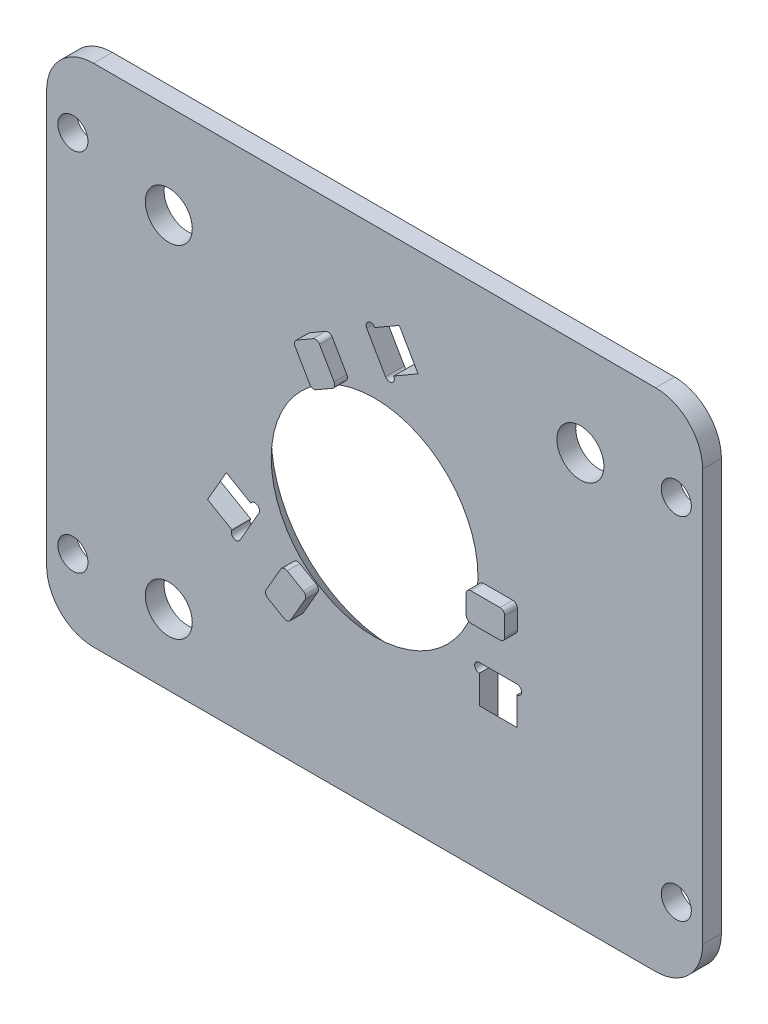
ISO-10303-21;
HEADER;
FILE_DESCRIPTION(('STEP AP214'),'2;1');
FILE_NAME('part.step','',(''),(''),'','','');
FILE_SCHEMA(('AUTOMOTIVE_DESIGN { 1 0 10303 214 1 1 1 1 }'));
ENDSEC;
DATA;
#1=APPLICATION_CONTEXT('core data for automotive mechanical design processes');
#2=APPLICATION_PROTOCOL_DEFINITION('international standard','automotive_design',2000,#1);
#3=PRODUCT_CONTEXT('',#1,'mechanical');
#4=PRODUCT('Part','Part','',(#3));
#5=PRODUCT_RELATED_PRODUCT_CATEGORY('part','',(#4));
#6=PRODUCT_DEFINITION_FORMATION('','',#4);
#7=PRODUCT_DEFINITION_CONTEXT('part definition',#1,'design');
#8=PRODUCT_DEFINITION('design','',#6,#7);
#9=PRODUCT_DEFINITION_SHAPE('','',#8);
#10=(LENGTH_UNIT() NAMED_UNIT(*) SI_UNIT(.MILLI.,.METRE.));
#11=(NAMED_UNIT(*) PLANE_ANGLE_UNIT() SI_UNIT($,.RADIAN.));
#12=(NAMED_UNIT(*) SI_UNIT($,.STERADIAN.) SOLID_ANGLE_UNIT());
#13=UNCERTAINTY_MEASURE_WITH_UNIT(LENGTH_MEASURE(1.E-05),#10,'distance_accuracy_value','');
#14=(GEOMETRIC_REPRESENTATION_CONTEXT(3) GLOBAL_UNCERTAINTY_ASSIGNED_CONTEXT((#13)) GLOBAL_UNIT_ASSIGNED_CONTEXT((#10,
#11,#12)) REPRESENTATION_CONTEXT('',''));
#15=CARTESIAN_POINT('',(0.,0.,0.));
#16=DIRECTION('',(0.,0.,1.));
#17=DIRECTION('',(1.,0.,0.));
#18=AXIS2_PLACEMENT_3D('',#15,#16,#17);
#19=CARTESIAN_POINT('',(0.,0.,2.));
#20=DIRECTION('',(0.,0.,1.));
#21=DIRECTION('',(1.,0.,0.));
#22=AXIS2_PLACEMENT_3D('',#19,#20,#21);
#23=PLANE('',#22);
#24=DIRECTION('',(-0.86602540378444,-0.499999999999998,0.));
#25=VECTOR('',#24,1.);
#26=CARTESIAN_POINT('',(2.62720170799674,19.010528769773,2.));
#27=LINE('',#26,#25);
#28=CARTESIAN_POINT('',(2.62720170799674,19.010528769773,2.));
#29=VERTEX_POINT('',#28);
#30=CARTESIAN_POINT('',(0.0291254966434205,17.510528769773,2.));
#31=VERTEX_POINT('',#30);
#32=EDGE_CURVE('E368',#29,#31,#27,.T.);
#33=ORIENTED_EDGE('',*,*,#32,.F.);
#34=DIRECTION('',(0.499999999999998,-0.86602540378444,0.));
#35=VECTOR('',#34,1.);
#36=CARTESIAN_POINT('',(2.62720170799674,19.010528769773,2.));
#37=LINE('',#36,#35);
#38=CARTESIAN_POINT('',(4.62720170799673,15.5464271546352,2.));
#39=VERTEX_POINT('',#38);
#40=EDGE_CURVE('E365',#29,#39,#37,.T.);
#41=ORIENTED_EDGE('',*,*,#40,.T.);
#42=DIRECTION('',(-0.86602540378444,-0.499999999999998,0.));
#43=VECTOR('',#42,1.);
#44=CARTESIAN_POINT('',(4.62720170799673,15.5464271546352,2.));
#45=LINE('',#44,#43);
#46=CARTESIAN_POINT('',(2.02912549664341,14.0464271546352,2.));
#47=VERTEX_POINT('',#46);
#48=EDGE_CURVE('E378',#39,#47,#45,.T.);
#49=ORIENTED_EDGE('',*,*,#48,.T.);
#50=CARTESIAN_POINT('',(1.59611279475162,13.7964271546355,2.));
#51=DIRECTION('',(0.,0.,1.));
#52=DIRECTION('',(1.,0.,0.));
#53=AXIS2_PLACEMENT_3D('',#50,#51,#52);
#54=CIRCLE('',#53,0.5);
#55=CARTESIAN_POINT('',(1.16310009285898,13.5464271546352,2.));
#56=VERTEX_POINT('',#55);
#57=EDGE_CURVE('E680',#56,#47,#54,.T.);
#58=ORIENTED_EDGE('',*,*,#57,.F.);
#59=DIRECTION('',(0.499999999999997,-0.86602540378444,0.));
#60=VECTOR('',#59,1.);
#61=CARTESIAN_POINT('',(6.73810009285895,3.89024390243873,2.));
#62=LINE('',#61,#60);
#63=CARTESIAN_POINT('',(-0.836899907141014,17.010528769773,2.));
#64=VERTEX_POINT('',#63);
#65=EDGE_CURVE('E683',#64,#56,#62,.T.);
#66=ORIENTED_EDGE('',*,*,#65,.F.);
#67=CARTESIAN_POINT('',(-0.403887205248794,17.260528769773,2.));
#68=DIRECTION('',(0.,0.,1.));
#69=DIRECTION('',(1.,0.,0.));
#70=AXIS2_PLACEMENT_3D('',#67,#68,#69);
#71=CIRCLE('',#70,0.500000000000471);
#72=EDGE_CURVE('E687',#31,#64,#71,.T.);
#73=ORIENTED_EDGE('',*,*,#72,.F.);
#74=EDGE_LOOP('',(#33,#41,#49,#58,#66,#73));
#75=FACE_BOUND('',#74,.T.);
#76=DIRECTION('',(0.,1.,0.));
#77=VECTOR('',#76,1.);
#78=CARTESIAN_POINT('',(15.1464848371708,-8.78048780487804,2.));
#79=LINE('',#78,#77);
#80=CARTESIAN_POINT('',(15.1464848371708,-11.780487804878,2.));
#81=VERTEX_POINT('',#80);
#82=CARTESIAN_POINT('',(15.1464848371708,-8.78048780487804,2.));
#83=VERTEX_POINT('',#82);
#84=EDGE_CURVE('E420',#81,#83,#79,.T.);
#85=ORIENTED_EDGE('',*,*,#84,.F.);
#86=DIRECTION('',(-1.,0.,0.));
#87=VECTOR('',#86,1.);
#88=CARTESIAN_POINT('',(15.1464848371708,-11.780487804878,2.));
#89=LINE('',#88,#87);
#90=CARTESIAN_POINT('',(11.1464848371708,-11.780487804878,2.));
#91=VERTEX_POINT('',#90);
#92=EDGE_CURVE('E429',#81,#91,#89,.T.);
#93=ORIENTED_EDGE('',*,*,#92,.T.);
#94=DIRECTION('',(0.,1.,0.));
#95=VECTOR('',#94,1.);
#96=CARTESIAN_POINT('',(11.1464848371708,-8.78048780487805,2.));
#97=LINE('',#96,#95);
#98=CARTESIAN_POINT('',(11.1464848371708,-8.78048780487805,2.));
#99=VERTEX_POINT('',#98);
#100=EDGE_CURVE('E417',#91,#99,#97,.T.);
#101=ORIENTED_EDGE('',*,*,#100,.T.);
#102=CARTESIAN_POINT('',(11.1464848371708,-8.28048780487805,2.));
#103=DIRECTION('',(0.,0.,1.));
#104=DIRECTION('',(1.,0.,0.));
#105=AXIS2_PLACEMENT_3D('',#102,#103,#104);
#106=CIRCLE('',#105,0.500000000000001);
#107=CARTESIAN_POINT('',(11.1464848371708,-7.78048780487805,2.));
#108=VERTEX_POINT('',#107);
#109=EDGE_CURVE('E701',#108,#99,#106,.T.);
#110=ORIENTED_EDGE('',*,*,#109,.F.);
#111=DIRECTION('',(1.,0.,0.));
#112=VECTOR('',#111,1.);
#113=CARTESIAN_POINT('',(0.,-7.78048780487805,2.));
#114=LINE('',#113,#112);
#115=CARTESIAN_POINT('',(15.1464848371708,-7.78048780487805,2.));
#116=VERTEX_POINT('',#115);
#117=EDGE_CURVE('E704',#108,#116,#114,.T.);
#118=ORIENTED_EDGE('',*,*,#117,.T.);
#119=CARTESIAN_POINT('',(15.1464848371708,-8.28048780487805,2.));
#120=DIRECTION('',(0.,0.,1.));
#121=DIRECTION('',(1.,0.,0.));
#122=AXIS2_PLACEMENT_3D('',#119,#120,#121);
#123=CIRCLE('',#122,0.500000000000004);
#124=EDGE_CURVE('E698',#83,#116,#123,.T.);
#125=ORIENTED_EDGE('',*,*,#124,.F.);
#126=EDGE_LOOP('',(#85,#93,#101,#110,#118,#125));
#127=FACE_BOUND('',#126,.T.);
#128=CARTESIAN_POINT('',(-21.9,-19.4,2.));
#129=DIRECTION('',(0.,0.,1.));
#130=DIRECTION('',(1.,0.,0.));
#131=AXIS2_PLACEMENT_3D('',#128,#129,#130);
#132=CIRCLE('',#131,2.5);
#133=CARTESIAN_POINT('',(-19.4,-19.4,2.));
#134=VERTEX_POINT('',#133);
#135=EDGE_CURVE('E441',#134,#134,#132,.T.);
#136=ORIENTED_EDGE('',*,*,#135,.F.);
#137=EDGE_LOOP('',(#136));
#138=FACE_BOUND('',#137,.T.);
#139=CARTESIAN_POINT('',(21.9,16.9043170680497,2.));
#140=DIRECTION('',(0.,0.,1.));
#141=DIRECTION('',(-1.,0.,0.));
#142=AXIS2_PLACEMENT_3D('',#139,#140,#141);
#143=CIRCLE('',#142,2.5);
#144=CARTESIAN_POINT('',(19.4,16.9043170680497,2.));
#145=VERTEX_POINT('',#144);
#146=EDGE_CURVE('E434',#145,#145,#143,.T.);
#147=ORIENTED_EDGE('',*,*,#146,.F.);
#148=EDGE_LOOP('',(#147));
#149=FACE_BOUND('',#148,.T.);
#150=CARTESIAN_POINT('',(-21.9,16.9043170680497,2.));
#151=DIRECTION('',(0.,0.,1.));
#152=DIRECTION('',(1.,0.,0.));
#153=AXIS2_PLACEMENT_3D('',#150,#151,#152);
#154=CIRCLE('',#153,2.5);
#155=CARTESIAN_POINT('',(-19.4,16.9043170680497,2.));
#156=VERTEX_POINT('',#155);
#157=EDGE_CURVE('E437',#156,#156,#154,.T.);
#158=ORIENTED_EDGE('',*,*,#157,.F.);
#159=EDGE_LOOP('',(#158));
#160=FACE_BOUND('',#159,.T.);
#161=CARTESIAN_POINT('',(32.1,-19.4,2.));
#162=DIRECTION('',(0.,0.,1.));
#163=DIRECTION('',(1.,0.,0.));
#164=AXIS2_PLACEMENT_3D('',#161,#162,#163);
#165=CIRCLE('',#164,1.6);
#166=CARTESIAN_POINT('',(33.7,-19.4,2.));
#167=VERTEX_POINT('',#166);
#168=EDGE_CURVE('E472',#167,#167,#165,.F.);
#169=ORIENTED_EDGE('',*,*,#168,.T.);
#170=EDGE_LOOP('',(#169));
#171=FACE_BOUND('',#170,.T.);
#172=CARTESIAN_POINT('',(-32.1,-19.4,2.));
#173=DIRECTION('',(0.,0.,1.));
#174=DIRECTION('',(1.,0.,0.));
#175=AXIS2_PLACEMENT_3D('',#172,#173,#174);
#176=CIRCLE('',#175,1.6);
#177=CARTESIAN_POINT('',(-30.5,-19.4,2.));
#178=VERTEX_POINT('',#177);
#179=EDGE_CURVE('E469',#178,#178,#176,.F.);
#180=ORIENTED_EDGE('',*,*,#179,.T.);
#181=EDGE_LOOP('',(#180));
#182=FACE_BOUND('',#181,.T.);
#183=CARTESIAN_POINT('',(-32.1,19.4043170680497,2.));
#184=DIRECTION('',(0.,0.,1.));
#185=DIRECTION('',(1.,0.,0.));
#186=AXIS2_PLACEMENT_3D('',#183,#184,#185);
#187=CIRCLE('',#186,1.6);
#188=CARTESIAN_POINT('',(-30.5,19.4043170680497,2.));
#189=VERTEX_POINT('',#188);
#190=EDGE_CURVE('E466',#189,#189,#187,.F.);
#191=ORIENTED_EDGE('',*,*,#190,.T.);
#192=EDGE_LOOP('',(#191));
#193=FACE_BOUND('',#192,.T.);
#194=CARTESIAN_POINT('',(32.1,17.9043170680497,2.));
#195=DIRECTION('',(0.,0.,1.));
#196=DIRECTION('',(1.,0.,0.));
#197=AXIS2_PLACEMENT_3D('',#194,#195,#196);
#198=CIRCLE('',#197,1.6);
#199=CARTESIAN_POINT('',(33.7,17.9043170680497,2.));
#200=VERTEX_POINT('',#199);
#201=EDGE_CURVE('E463',#200,#200,#198,.F.);
#202=ORIENTED_EDGE('',*,*,#201,.T.);
#203=EDGE_LOOP('',(#202));
#204=FACE_BOUND('',#203,.T.);
#205=CARTESIAN_POINT('',(0.,0.,2.));
#206=DIRECTION('',(0.,0.,-1.));
#207=DIRECTION('',(-1.,0.,0.));
#208=AXIS2_PLACEMENT_3D('',#205,#206,#207);
#209=CIRCLE('',#208,11.);
#210=CARTESIAN_POINT('',(-11.,0.,2.));
#211=VERTEX_POINT('',#210);
#212=EDGE_CURVE('E478',#211,#211,#209,.T.);
#213=ORIENTED_EDGE('',*,*,#212,.T.);
#214=EDGE_LOOP('',(#213));
#215=FACE_BOUND('',#214,.T.);
#216=CARTESIAN_POINT('',(11.5964848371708,-0.780487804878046,2.));
#217=DIRECTION('',(0.,0.,1.));
#218=DIRECTION('',(1.,0.,0.));
#219=AXIS2_PLACEMENT_3D('',#216,#217,#218);
#220=CIRCLE('',#219,0.5);
#221=CARTESIAN_POINT('',(11.0964848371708,-0.78048780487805,2.));
#222=VERTEX_POINT('',#221);
#223=CARTESIAN_POINT('',(11.5964848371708,-0.280487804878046,2.));
#224=VERTEX_POINT('',#223);
#225=EDGE_CURVE('E589',#222,#224,#220,.F.);
#226=ORIENTED_EDGE('',*,*,#225,.T.);
#227=DIRECTION('',(1.,0.,0.));
#228=VECTOR('',#227,1.);
#229=CARTESIAN_POINT('',(0.,-0.280487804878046,2.));
#230=LINE('',#229,#228);
#231=CARTESIAN_POINT('',(14.6964848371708,-0.280487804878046,2.));
#232=VERTEX_POINT('',#231);
#233=EDGE_CURVE('E591',#224,#232,#230,.T.);
#234=ORIENTED_EDGE('',*,*,#233,.T.);
#235=CARTESIAN_POINT('',(14.6964848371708,-0.780487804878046,2.));
#236=DIRECTION('',(0.,0.,1.));
#237=DIRECTION('',(1.,0.,0.));
#238=AXIS2_PLACEMENT_3D('',#235,#236,#237);
#239=CIRCLE('',#238,0.5);
#240=CARTESIAN_POINT('',(15.1964848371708,-0.780487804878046,2.));
#241=VERTEX_POINT('',#240);
#242=EDGE_CURVE('E576',#241,#232,#239,.T.);
#243=ORIENTED_EDGE('',*,*,#242,.F.);
#244=DIRECTION('',(0.,-1.,0.));
#245=VECTOR('',#244,1.);
#246=CARTESIAN_POINT('',(15.1964848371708,0.,2.));
#247=LINE('',#246,#245);
#248=CARTESIAN_POINT('',(15.1964848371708,-2.78048780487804,2.));
#249=VERTEX_POINT('',#248);
#250=EDGE_CURVE('E579',#241,#249,#247,.T.);
#251=ORIENTED_EDGE('',*,*,#250,.T.);
#252=CARTESIAN_POINT('',(14.6964848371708,-2.78048780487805,2.));
#253=DIRECTION('',(0.,0.,1.));
#254=DIRECTION('',(1.,0.,0.));
#255=AXIS2_PLACEMENT_3D('',#252,#253,#254);
#256=CIRCLE('',#255,0.5);
#257=CARTESIAN_POINT('',(14.6964848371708,-3.28048780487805,2.));
#258=VERTEX_POINT('',#257);
#259=EDGE_CURVE('E581',#249,#258,#256,.F.);
#260=ORIENTED_EDGE('',*,*,#259,.T.);
#261=DIRECTION('',(-1.,0.,0.));
#262=VECTOR('',#261,1.);
#263=CARTESIAN_POINT('',(0.,-3.28048780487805,2.));
#264=LINE('',#263,#262);
#265=CARTESIAN_POINT('',(11.5964848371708,-3.28048780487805,2.));
#266=VERTEX_POINT('',#265);
#267=EDGE_CURVE('E583',#258,#266,#264,.T.);
#268=ORIENTED_EDGE('',*,*,#267,.T.);
#269=CARTESIAN_POINT('',(11.5964848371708,-2.78048780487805,2.));
#270=DIRECTION('',(0.,0.,1.));
#271=DIRECTION('',(1.,0.,0.));
#272=AXIS2_PLACEMENT_3D('',#269,#270,#271);
#273=CIRCLE('',#272,0.5);
#274=CARTESIAN_POINT('',(11.0964848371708,-2.78048780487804,2.));
#275=VERTEX_POINT('',#274);
#276=EDGE_CURVE('E585',#266,#275,#273,.F.);
#277=ORIENTED_EDGE('',*,*,#276,.T.);
#278=DIRECTION('',(0.,1.,0.));
#279=VECTOR('',#278,1.);
#280=CARTESIAN_POINT('',(11.0964848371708,0.,2.));
#281=LINE('',#280,#279);
#282=EDGE_CURVE('E587',#275,#222,#281,.T.);
#283=ORIENTED_EDGE('',*,*,#282,.T.);
#284=EDGE_LOOP('',(#226,#234,#243,#251,#260,#268,#277,#283));
#285=FACE_BOUND('',#284,.T.);
#286=DIRECTION('',(0.499999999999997,-0.86602540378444,0.));
#287=VECTOR('',#286,1.);
#288=CARTESIAN_POINT('',(0.242909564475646,0.140243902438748,2.));
#289=LINE('',#288,#287);
#290=CARTESIAN_POINT('',(-7.10709043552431,12.87081733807,2.));
#291=VERTEX_POINT('',#290);
#292=CARTESIAN_POINT('',(-5.55709043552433,10.1861385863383,2.));
#293=VERTEX_POINT('',#292);
#294=EDGE_CURVE('E729',#291,#293,#289,.T.);
#295=ORIENTED_EDGE('',*,*,#294,.F.);
#296=CARTESIAN_POINT('',(-6.6740777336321,13.12081733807,2.));
#297=DIRECTION('',(0.,0.,1.));
#298=DIRECTION('',(1.,0.,0.));
#299=AXIS2_PLACEMENT_3D('',#296,#297,#298);
#300=CIRCLE('',#299,0.5);
#301=CARTESIAN_POINT('',(-6.9240777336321,13.5538300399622,2.));
#302=VERTEX_POINT('',#301);
#303=EDGE_CURVE('E731',#291,#302,#300,.F.);
#304=ORIENTED_EDGE('',*,*,#303,.T.);
#305=DIRECTION('',(0.86602540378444,0.499999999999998,0.));
#306=VECTOR('',#305,1.);
#307=CARTESIAN_POINT('',(-7.59999999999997,13.1635861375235,2.));
#308=LINE('',#307,#306);
#309=CARTESIAN_POINT('',(-5.19202692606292,14.5538300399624,2.));
#310=VERTEX_POINT('',#309);
#311=EDGE_CURVE('E734',#302,#310,#308,.T.);
#312=ORIENTED_EDGE('',*,*,#311,.T.);
#313=CARTESIAN_POINT('',(-4.94202692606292,14.1208173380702,2.));
#314=DIRECTION('',(0.,0.,1.));
#315=DIRECTION('',(1.,0.,0.));
#316=AXIS2_PLACEMENT_3D('',#313,#314,#315);
#317=CIRCLE('',#316,0.5);
#318=CARTESIAN_POINT('',(-4.50901422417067,14.3708173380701,2.));
#319=VERTEX_POINT('',#318);
#320=EDGE_CURVE('E737',#310,#319,#317,.F.);
#321=ORIENTED_EDGE('',*,*,#320,.T.);
#322=DIRECTION('',(0.499999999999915,-0.866025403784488,0.));
#323=VECTOR('',#322,1.);
#324=CARTESIAN_POINT('',(2.84098577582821,1.64024390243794,2.));
#325=LINE('',#324,#323);
#326=CARTESIAN_POINT('',(-2.95901422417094,11.6861385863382,2.));
#327=VERTEX_POINT('',#326);
#328=EDGE_CURVE('E740',#319,#327,#325,.T.);
#329=ORIENTED_EDGE('',*,*,#328,.T.);
#330=CARTESIAN_POINT('',(-3.39202692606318,11.4361385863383,2.));
#331=DIRECTION('',(0.,0.,1.));
#332=DIRECTION('',(1.,0.,0.));
#333=AXIS2_PLACEMENT_3D('',#330,#331,#332);
#334=CIRCLE('',#333,0.5);
#335=CARTESIAN_POINT('',(-3.14202692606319,11.0031258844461,2.));
#336=VERTEX_POINT('',#335);
#337=EDGE_CURVE('E743',#327,#336,#334,.F.);
#338=ORIENTED_EDGE('',*,*,#337,.T.);
#339=DIRECTION('',(-0.86602540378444,-0.499999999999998,0.));
#340=VECTOR('',#339,1.);
#341=CARTESIAN_POINT('',(-5.54999999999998,9.61288198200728,2.));
#342=LINE('',#341,#340);
#343=CARTESIAN_POINT('',(-4.8740777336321,10.003125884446,2.));
#344=VERTEX_POINT('',#343);
#345=EDGE_CURVE('E746',#336,#344,#342,.T.);
#346=ORIENTED_EDGE('',*,*,#345,.T.);
#347=CARTESIAN_POINT('',(-5.1240777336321,10.4361385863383,2.));
#348=DIRECTION('',(0.,0.,1.));
#349=DIRECTION('',(1.,0.,0.));
#350=AXIS2_PLACEMENT_3D('',#347,#348,#349);
#351=CIRCLE('',#350,0.5);
#352=EDGE_CURVE('E749',#293,#344,#351,.T.);
#353=ORIENTED_EDGE('',*,*,#352,.F.);
#354=EDGE_LOOP('',(#295,#304,#312,#321,#329,#338,#346,#353));
#355=FACE_BOUND('',#354,.T.);
#356=DIRECTION('',(0.499999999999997,0.86602540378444,0.));
#357=VECTOR('',#356,1.);
#358=CARTESIAN_POINT('',(-0.242909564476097,0.140243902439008,2.));
#359=LINE('',#358,#357);
#360=CARTESIAN_POINT('',(-7.59290956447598,-12.5903295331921,2.));
#361=VERTEX_POINT('',#360);
#362=CARTESIAN_POINT('',(-6.04290956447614,-9.90565078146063,2.));
#363=VERTEX_POINT('',#362);
#364=EDGE_CURVE('E706',#361,#363,#359,.T.);
#365=ORIENTED_EDGE('',*,*,#364,.F.);
#366=CARTESIAN_POINT('',(-8.0259222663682,-12.3403295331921,2.));
#367=DIRECTION('',(0.,0.,1.));
#368=DIRECTION('',(1.,0.,0.));
#369=AXIS2_PLACEMENT_3D('',#366,#367,#368);
#370=CIRCLE('',#369,0.5);
#371=CARTESIAN_POINT('',(-8.2759222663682,-12.7733422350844,2.));
#372=VERTEX_POINT('',#371);
#373=EDGE_CURVE('E709',#361,#372,#370,.F.);
#374=ORIENTED_EDGE('',*,*,#373,.T.);
#375=DIRECTION('',(0.86602540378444,-0.499999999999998,0.));
#376=VECTOR('',#375,1.);
#377=CARTESIAN_POINT('',(-7.59999999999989,-13.1635861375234,2.));
#378=LINE('',#377,#376);
#379=CARTESIAN_POINT('',(-10.007973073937,-11.7733422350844,2.));
#380=VERTEX_POINT('',#379);
#381=EDGE_CURVE('E711',#380,#372,#378,.T.);
#382=ORIENTED_EDGE('',*,*,#381,.F.);
#383=CARTESIAN_POINT('',(-9.75797307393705,-11.3403295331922,2.));
#384=DIRECTION('',(0.,0.,1.));
#385=DIRECTION('',(1.,0.,0.));
#386=AXIS2_PLACEMENT_3D('',#383,#384,#385);
#387=CIRCLE('',#386,0.5);
#388=CARTESIAN_POINT('',(-10.1909857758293,-11.0903295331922,2.));
#389=VERTEX_POINT('',#388);
#390=EDGE_CURVE('E714',#389,#380,#387,.T.);
#391=ORIENTED_EDGE('',*,*,#390,.F.);
#392=DIRECTION('',(-0.499999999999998,-0.86602540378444,0.));
#393=VECTOR('',#392,1.);
#394=CARTESIAN_POINT('',(-2.84098577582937,1.64024390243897,2.));
#395=LINE('',#394,#393);
#396=CARTESIAN_POINT('',(-8.64098577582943,-8.40565078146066,2.));
#397=VERTEX_POINT('',#396);
#398=EDGE_CURVE('E717',#397,#389,#395,.T.);
#399=ORIENTED_EDGE('',*,*,#398,.F.);
#400=CARTESIAN_POINT('',(-8.2079730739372,-8.65565078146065,2.));
#401=DIRECTION('',(0.,0.,1.));
#402=DIRECTION('',(1.,0.,0.));
#403=AXIS2_PLACEMENT_3D('',#400,#401,#402);
#404=CIRCLE('',#403,0.5);
#405=CARTESIAN_POINT('',(-7.9579730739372,-8.22263807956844,2.));
#406=VERTEX_POINT('',#405);
#407=EDGE_CURVE('E720',#406,#397,#404,.T.);
#408=ORIENTED_EDGE('',*,*,#407,.F.);
#409=DIRECTION('',(-0.86602540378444,0.499999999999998,0.));
#410=VECTOR('',#409,1.);
#411=CARTESIAN_POINT('',(-5.55000000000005,-9.61288198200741,2.));
#412=LINE('',#411,#410);
#413=CARTESIAN_POINT('',(-6.22592226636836,-9.22263807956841,2.));
#414=VERTEX_POINT('',#413);
#415=EDGE_CURVE('E723',#414,#406,#412,.T.);
#416=ORIENTED_EDGE('',*,*,#415,.F.);
#417=CARTESIAN_POINT('',(-6.47592226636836,-9.65565078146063,2.));
#418=DIRECTION('',(0.,0.,1.));
#419=DIRECTION('',(1.,0.,0.));
#420=AXIS2_PLACEMENT_3D('',#417,#418,#419);
#421=CIRCLE('',#420,0.5);
#422=EDGE_CURVE('E726',#363,#414,#421,.T.);
#423=ORIENTED_EDGE('',*,*,#422,.F.);
#424=EDGE_LOOP('',(#365,#374,#382,#391,#399,#408,#416,#423));
#425=FACE_BOUND('',#424,.T.);
#426=DIRECTION('',(0.,-1.,0.));
#427=VECTOR('',#426,1.);
#428=CARTESIAN_POINT('',(34.9,0.,2.));
#429=LINE('',#428,#427);
#430=CARTESIAN_POINT('',(34.9,21.9043170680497,2.));
#431=VERTEX_POINT('',#430);
#432=CARTESIAN_POINT('',(34.9,-21.9,2.));
#433=VERTEX_POINT('',#432);
#434=EDGE_CURVE('E529',#431,#433,#429,.T.);
#435=ORIENTED_EDGE('',*,*,#434,.F.);
#436=CARTESIAN_POINT('',(29.9,21.9043170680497,2.));
#437=DIRECTION('',(0.,0.,1.));
#438=DIRECTION('',(1.,0.,0.));
#439=AXIS2_PLACEMENT_3D('',#436,#437,#438);
#440=CIRCLE('',#439,5.);
#441=CARTESIAN_POINT('',(29.9,26.9043170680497,2.));
#442=VERTEX_POINT('',#441);
#443=EDGE_CURVE('E531',#431,#442,#440,.T.);
#444=ORIENTED_EDGE('',*,*,#443,.T.);
#445=DIRECTION('',(1.,0.,0.));
#446=VECTOR('',#445,1.);
#447=CARTESIAN_POINT('',(0.,26.9043170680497,2.));
#448=LINE('',#447,#446);
#449=CARTESIAN_POINT('',(-29.9,26.9043170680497,2.));
#450=VERTEX_POINT('',#449);
#451=EDGE_CURVE('E505',#450,#442,#448,.T.);
#452=ORIENTED_EDGE('',*,*,#451,.F.);
#453=CARTESIAN_POINT('',(-29.9,21.9043170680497,2.));
#454=DIRECTION('',(0.,0.,1.));
#455=DIRECTION('',(1.,0.,0.));
#456=AXIS2_PLACEMENT_3D('',#453,#454,#455);
#457=CIRCLE('',#456,5.);
#458=CARTESIAN_POINT('',(-34.9,21.9043170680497,2.));
#459=VERTEX_POINT('',#458);
#460=EDGE_CURVE('E519',#459,#450,#457,.F.);
#461=ORIENTED_EDGE('',*,*,#460,.F.);
#462=DIRECTION('',(0.,1.,0.));
#463=VECTOR('',#462,1.);
#464=CARTESIAN_POINT('',(-34.9,0.,2.));
#465=LINE('',#464,#463);
#466=CARTESIAN_POINT('',(-34.9,-21.9,2.));
#467=VERTEX_POINT('',#466);
#468=EDGE_CURVE('E521',#467,#459,#465,.T.);
#469=ORIENTED_EDGE('',*,*,#468,.F.);
#470=CARTESIAN_POINT('',(-29.9,-21.9,2.));
#471=DIRECTION('',(0.,0.,1.));
#472=DIRECTION('',(1.,0.,0.));
#473=AXIS2_PLACEMENT_3D('',#470,#471,#472);
#474=CIRCLE('',#473,5.);
#475=CARTESIAN_POINT('',(-29.9,-26.9,2.));
#476=VERTEX_POINT('',#475);
#477=EDGE_CURVE('E523',#476,#467,#474,.F.);
#478=ORIENTED_EDGE('',*,*,#477,.F.);
#479=DIRECTION('',(-1.,0.,0.));
#480=VECTOR('',#479,1.);
#481=CARTESIAN_POINT('',(0.,-26.9,2.));
#482=LINE('',#481,#480);
#483=CARTESIAN_POINT('',(29.9,-26.9,2.));
#484=VERTEX_POINT('',#483);
#485=EDGE_CURVE('E525',#484,#476,#482,.T.);
#486=ORIENTED_EDGE('',*,*,#485,.F.);
#487=CARTESIAN_POINT('',(29.9,-21.9,2.));
#488=DIRECTION('',(0.,0.,1.));
#489=DIRECTION('',(1.,0.,0.));
#490=AXIS2_PLACEMENT_3D('',#487,#488,#489);
#491=CIRCLE('',#490,5.);
#492=EDGE_CURVE('E527',#433,#484,#491,.F.);
#493=ORIENTED_EDGE('',*,*,#492,.F.);
#494=EDGE_LOOP('',(#435,#444,#452,#461,#469,#478,#486,#493));
#495=FACE_BOUND('',#494,.T.);
#496=CARTESIAN_POINT('',(-14.7461127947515,-8.98004096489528,2.));
#497=DIRECTION('',(0.,0.,1.));
#498=DIRECTION('',(1.,0.,0.));
#499=AXIS2_PLACEMENT_3D('',#496,#497,#498);
#500=CIRCLE('',#499,0.500000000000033);
#501=CARTESIAN_POINT('',(-15.1791254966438,-8.73004096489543,2.));
#502=VERTEX_POINT('',#501);
#503=CARTESIAN_POINT('',(-14.3131000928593,-9.2300409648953,2.));
#504=VERTEX_POINT('',#503);
#505=EDGE_CURVE('E690',#502,#504,#500,.T.);
#506=ORIENTED_EDGE('',*,*,#505,.F.);
#507=DIRECTION('',(0.86602540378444,-0.499999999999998,0.));
#508=VECTOR('',#507,1.);
#509=CARTESIAN_POINT('',(-17.7772017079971,-7.23004096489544,2.));
#510=LINE('',#509,#508);
#511=CARTESIAN_POINT('',(-17.7772017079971,-7.23004096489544,2.));
#512=VERTEX_POINT('',#511);
#513=EDGE_CURVE('E394',#512,#502,#510,.T.);
#514=ORIENTED_EDGE('',*,*,#513,.F.);
#515=DIRECTION('',(0.499999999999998,0.86602540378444,0.));
#516=VECTOR('',#515,1.);
#517=CARTESIAN_POINT('',(-17.7772017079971,-7.23004096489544,2.));
#518=LINE('',#517,#516);
#519=CARTESIAN_POINT('',(-15.7772017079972,-3.76593934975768,2.));
#520=VERTEX_POINT('',#519);
#521=EDGE_CURVE('E400',#512,#520,#518,.T.);
#522=ORIENTED_EDGE('',*,*,#521,.T.);
#523=DIRECTION('',(0.86602540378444,-0.499999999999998,0.));
#524=VECTOR('',#523,1.);
#525=CARTESIAN_POINT('',(-15.7772017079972,-3.76593934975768,2.));
#526=LINE('',#525,#524);
#527=CARTESIAN_POINT('',(-13.1791254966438,-5.26593934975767,2.));
#528=VERTEX_POINT('',#527);
#529=EDGE_CURVE('E403',#520,#528,#526,.T.);
#530=ORIENTED_EDGE('',*,*,#529,.T.);
#531=CARTESIAN_POINT('',(-12.7461127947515,-5.51593934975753,2.));
#532=DIRECTION('',(0.,0.,1.));
#533=DIRECTION('',(1.,0.,0.));
#534=AXIS2_PLACEMENT_3D('',#531,#532,#533);
#535=CIRCLE('',#534,0.499999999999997);
#536=CARTESIAN_POINT('',(-12.3131000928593,-5.76593934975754,2.));
#537=VERTEX_POINT('',#536);
#538=EDGE_CURVE('E693',#537,#528,#535,.T.);
#539=ORIENTED_EDGE('',*,*,#538,.F.);
#540=DIRECTION('',(-0.499999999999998,-0.86602540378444,0.));
#541=VECTOR('',#540,1.);
#542=CARTESIAN_POINT('',(-6.73810009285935,3.89024390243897,2.));
#543=LINE('',#542,#541);
#544=EDGE_CURVE('E696',#537,#504,#543,.T.);
#545=ORIENTED_EDGE('',*,*,#544,.T.);
#546=EDGE_LOOP('',(#506,#514,#522,#530,#539,#545));
#547=FACE_BOUND('',#546,.T.);
#548=ADVANCED_FACE('F39',(#75,#127,#138,#149,#160,#171,#182,#193,#204,#215,#285,#355,#425,#495,
#547),#23,.T.);
#549=CARTESIAN_POINT('',(0.,0.,0.));
#550=DIRECTION('',(0.,0.,1.));
#551=DIRECTION('',(1.,0.,0.));
#552=AXIS2_PLACEMENT_3D('',#549,#550,#551);
#553=PLANE('',#552);
#554=CARTESIAN_POINT('',(29.9,21.9043170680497,0.));
#555=DIRECTION('',(0.,0.,-1.));
#556=DIRECTION('',(-1.,0.,0.));
#557=AXIS2_PLACEMENT_3D('',#554,#555,#556);
#558=CIRCLE('',#557,5.);
#559=CARTESIAN_POINT('',(29.9,26.9043170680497,0.));
#560=VERTEX_POINT('',#559);
#561=CARTESIAN_POINT('',(34.9,21.9043170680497,0.));
#562=VERTEX_POINT('',#561);
#563=EDGE_CURVE('E64',#560,#562,#558,.T.);
#564=ORIENTED_EDGE('',*,*,#563,.T.);
#565=DIRECTION('',(0.,1.,0.));
#566=VECTOR('',#565,1.);
#567=CARTESIAN_POINT('',(34.9,0.,0.));
#568=LINE('',#567,#566);
#569=CARTESIAN_POINT('',(34.9,-21.9,0.));
#570=VERTEX_POINT('',#569);
#571=EDGE_CURVE('E499',#570,#562,#568,.T.);
#572=ORIENTED_EDGE('',*,*,#571,.F.);
#573=CARTESIAN_POINT('',(29.9,-21.9,0.));
#574=DIRECTION('',(0.,0.,-1.));
#575=DIRECTION('',(-1.,0.,0.));
#576=AXIS2_PLACEMENT_3D('',#573,#574,#575);
#577=CIRCLE('',#576,5.);
#578=CARTESIAN_POINT('',(29.9,-26.9,0.));
#579=VERTEX_POINT('',#578);
#580=EDGE_CURVE('E496',#579,#570,#577,.F.);
#581=ORIENTED_EDGE('',*,*,#580,.F.);
#582=DIRECTION('',(1.,0.,0.));
#583=VECTOR('',#582,1.);
#584=CARTESIAN_POINT('',(0.,-26.9,0.));
#585=LINE('',#584,#583);
#586=CARTESIAN_POINT('',(-29.9,-26.9,0.));
#587=VERTEX_POINT('',#586);
#588=EDGE_CURVE('E493',#587,#579,#585,.T.);
#589=ORIENTED_EDGE('',*,*,#588,.F.);
#590=CARTESIAN_POINT('',(-29.9,-21.9,0.));
#591=DIRECTION('',(0.,0.,-1.));
#592=DIRECTION('',(-1.,0.,0.));
#593=AXIS2_PLACEMENT_3D('',#590,#591,#592);
#594=CIRCLE('',#593,5.);
#595=CARTESIAN_POINT('',(-34.9,-21.9,0.));
#596=VERTEX_POINT('',#595);
#597=EDGE_CURVE('E490',#596,#587,#594,.F.);
#598=ORIENTED_EDGE('',*,*,#597,.F.);
#599=DIRECTION('',(0.,-1.,0.));
#600=VECTOR('',#599,1.);
#601=CARTESIAN_POINT('',(-34.9,0.,0.));
#602=LINE('',#601,#600);
#603=CARTESIAN_POINT('',(-34.9,21.9043170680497,0.));
#604=VERTEX_POINT('',#603);
#605=EDGE_CURVE('E487',#604,#596,#602,.T.);
#606=ORIENTED_EDGE('',*,*,#605,.F.);
#607=CARTESIAN_POINT('',(-29.9,21.9043170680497,0.));
#608=DIRECTION('',(0.,0.,-1.));
#609=DIRECTION('',(-1.,0.,0.));
#610=AXIS2_PLACEMENT_3D('',#607,#608,#609);
#611=CIRCLE('',#610,5.);
#612=CARTESIAN_POINT('',(-29.9,26.9043170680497,0.));
#613=VERTEX_POINT('',#612);
#614=EDGE_CURVE('E484',#613,#604,#611,.F.);
#615=ORIENTED_EDGE('',*,*,#614,.F.);
#616=DIRECTION('',(-1.,0.,0.));
#617=VECTOR('',#616,1.);
#618=CARTESIAN_POINT('',(0.,26.9043170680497,0.));
#619=LINE('',#618,#617);
#620=EDGE_CURVE('E482',#560,#613,#619,.T.);
#621=ORIENTED_EDGE('',*,*,#620,.F.);
#622=EDGE_LOOP('',(#564,#572,#581,#589,#598,#606,#615,#621));
#623=FACE_BOUND('',#622,.T.);
#624=DIRECTION('',(-1.,0.,0.));
#625=VECTOR('',#624,1.);
#626=CARTESIAN_POINT('',(15.1464848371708,-13.780487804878,0.));
#627=LINE('',#626,#625);
#628=CARTESIAN_POINT('',(15.1464848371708,-13.780487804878,0.));
#629=VERTEX_POINT('',#628);
#630=CARTESIAN_POINT('',(11.1464848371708,-13.780487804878,0.));
#631=VERTEX_POINT('',#630);
#632=EDGE_CURVE('E422',#629,#631,#627,.T.);
#633=ORIENTED_EDGE('',*,*,#632,.F.);
#634=DIRECTION('',(0.,-1.,0.));
#635=VECTOR('',#634,1.);
#636=CARTESIAN_POINT('',(15.1464848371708,-13.780487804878,0.));
#637=LINE('',#636,#635);
#638=CARTESIAN_POINT('',(15.1464848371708,-8.78048780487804,0.));
#639=VERTEX_POINT('',#638);
#640=EDGE_CURVE('E413',#639,#629,#637,.T.);
#641=ORIENTED_EDGE('',*,*,#640,.F.);
#642=CARTESIAN_POINT('',(15.1464848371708,-8.28048780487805,0.));
#643=DIRECTION('',(0.,0.,1.));
#644=DIRECTION('',(1.,0.,0.));
#645=AXIS2_PLACEMENT_3D('',#642,#643,#644);
#646=CIRCLE('',#645,0.500000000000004);
#647=CARTESIAN_POINT('',(15.1464848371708,-7.78048780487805,0.));
#648=VERTEX_POINT('',#647);
#649=EDGE_CURVE('E767',#639,#648,#646,.T.);
#650=ORIENTED_EDGE('',*,*,#649,.T.);
#651=DIRECTION('',(1.,0.,0.));
#652=VECTOR('',#651,1.);
#653=CARTESIAN_POINT('',(0.,-7.78048780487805,0.));
#654=LINE('',#653,#652);
#655=CARTESIAN_POINT('',(11.1464848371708,-7.78048780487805,0.));
#656=VERTEX_POINT('',#655);
#657=EDGE_CURVE('E684',#656,#648,#654,.T.);
#658=ORIENTED_EDGE('',*,*,#657,.F.);
#659=CARTESIAN_POINT('',(11.1464848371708,-8.28048780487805,0.));
#660=DIRECTION('',(0.,0.,1.));
#661=DIRECTION('',(1.,0.,0.));
#662=AXIS2_PLACEMENT_3D('',#659,#660,#661);
#663=CIRCLE('',#662,0.500000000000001);
#664=CARTESIAN_POINT('',(11.1464848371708,-8.78048780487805,0.));
#665=VERTEX_POINT('',#664);
#666=EDGE_CURVE('E770',#656,#665,#663,.T.);
#667=ORIENTED_EDGE('',*,*,#666,.T.);
#668=DIRECTION('',(0.,-1.,0.));
#669=VECTOR('',#668,1.);
#670=CARTESIAN_POINT('',(11.1464848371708,-13.780487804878,0.));
#671=LINE('',#670,#669);
#672=EDGE_CURVE('E410',#665,#631,#671,.T.);
#673=ORIENTED_EDGE('',*,*,#672,.T.);
#674=EDGE_LOOP('',(#633,#641,#650,#658,#667,#673));
#675=FACE_BOUND('',#674,.T.);
#676=DIRECTION('',(0.499999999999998,-0.86602540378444,0.));
#677=VECTOR('',#676,1.);
#678=CARTESIAN_POINT('',(4.35925251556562,20.010528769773,0.));
#679=LINE('',#678,#677);
#680=CARTESIAN_POINT('',(4.35925251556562,20.010528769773,0.));
#681=VERTEX_POINT('',#680);
#682=CARTESIAN_POINT('',(6.35925251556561,16.5464271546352,0.));
#683=VERTEX_POINT('',#682);
#684=EDGE_CURVE('E362',#681,#683,#679,.T.);
#685=ORIENTED_EDGE('',*,*,#684,.F.);
#686=DIRECTION('',(0.86602540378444,0.499999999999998,0.));
#687=VECTOR('',#686,1.);
#688=CARTESIAN_POINT('',(0.0291254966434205,17.510528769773,0.));
#689=LINE('',#688,#687);
#690=CARTESIAN_POINT('',(0.0291254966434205,17.510528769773,0.));
#691=VERTEX_POINT('',#690);
#692=EDGE_CURVE('E369',#691,#681,#689,.T.);
#693=ORIENTED_EDGE('',*,*,#692,.F.);
#694=CARTESIAN_POINT('',(-0.403887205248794,17.260528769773,0.));
#695=DIRECTION('',(0.,0.,1.));
#696=DIRECTION('',(1.,0.,0.));
#697=AXIS2_PLACEMENT_3D('',#694,#695,#696);
#698=CIRCLE('',#697,0.500000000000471);
#699=CARTESIAN_POINT('',(-0.836899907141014,17.010528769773,0.));
#700=VERTEX_POINT('',#699);
#701=EDGE_CURVE('E756',#691,#700,#698,.T.);
#702=ORIENTED_EDGE('',*,*,#701,.T.);
#703=DIRECTION('',(0.499999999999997,-0.86602540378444,0.));
#704=VECTOR('',#703,1.);
#705=CARTESIAN_POINT('',(6.73810009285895,3.89024390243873,0.));
#706=LINE('',#705,#704);
#707=CARTESIAN_POINT('',(1.16310009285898,13.5464271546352,0.));
#708=VERTEX_POINT('',#707);
#709=EDGE_CURVE('E753',#700,#708,#706,.T.);
#710=ORIENTED_EDGE('',*,*,#709,.T.);
#711=CARTESIAN_POINT('',(1.59611279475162,13.7964271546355,0.));
#712=DIRECTION('',(0.,0.,1.));
#713=DIRECTION('',(1.,0.,0.));
#714=AXIS2_PLACEMENT_3D('',#711,#712,#713);
#715=CIRCLE('',#714,0.5);
#716=CARTESIAN_POINT('',(2.02912549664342,14.0464271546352,0.));
#717=VERTEX_POINT('',#716);
#718=EDGE_CURVE('E679',#708,#717,#715,.T.);
#719=ORIENTED_EDGE('',*,*,#718,.T.);
#720=DIRECTION('',(0.86602540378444,0.499999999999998,0.));
#721=VECTOR('',#720,1.);
#722=CARTESIAN_POINT('',(2.02912549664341,14.0464271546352,0.));
#723=LINE('',#722,#721);
#724=EDGE_CURVE('E384',#717,#683,#723,.T.);
#725=ORIENTED_EDGE('',*,*,#724,.T.);
#726=EDGE_LOOP('',(#685,#693,#702,#710,#719,#725));
#727=FACE_BOUND('',#726,.T.);
#728=CARTESIAN_POINT('',(0.,0.,0.));
#729=DIRECTION('',(0.,0.,-1.));
#730=DIRECTION('',(-1.,0.,0.));
#731=AXIS2_PLACEMENT_3D('',#728,#729,#730);
#732=CIRCLE('',#731,13.);
#733=CARTESIAN_POINT('',(-13.,0.,0.));
#734=VERTEX_POINT('',#733);
#735=EDGE_CURVE('E475',#734,#734,#732,.T.);
#736=ORIENTED_EDGE('',*,*,#735,.F.);
#737=EDGE_LOOP('',(#736));
#738=FACE_BOUND('',#737,.T.);
#739=CARTESIAN_POINT('',(32.1,17.9043170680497,0.));
#740=DIRECTION('',(0.,0.,1.));
#741=DIRECTION('',(1.,0.,0.));
#742=AXIS2_PLACEMENT_3D('',#739,#740,#741);
#743=CIRCLE('',#742,1.6);
#744=CARTESIAN_POINT('',(33.7,17.9043170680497,0.));
#745=VERTEX_POINT('',#744);
#746=EDGE_CURVE('E455',#745,#745,#743,.T.);
#747=ORIENTED_EDGE('',*,*,#746,.T.);
#748=EDGE_LOOP('',(#747));
#749=FACE_BOUND('',#748,.T.);
#750=CARTESIAN_POINT('',(-32.1,19.4043170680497,0.));
#751=DIRECTION('',(0.,0.,1.));
#752=DIRECTION('',(1.,0.,0.));
#753=AXIS2_PLACEMENT_3D('',#750,#751,#752);
#754=CIRCLE('',#753,1.6);
#755=CARTESIAN_POINT('',(-30.5,19.4043170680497,0.));
#756=VERTEX_POINT('',#755);
#757=EDGE_CURVE('E452',#756,#756,#754,.T.);
#758=ORIENTED_EDGE('',*,*,#757,.T.);
#759=EDGE_LOOP('',(#758));
#760=FACE_BOUND('',#759,.T.);
#761=CARTESIAN_POINT('',(-32.1,-19.4,0.));
#762=DIRECTION('',(0.,0.,1.));
#763=DIRECTION('',(-1.,0.,0.));
#764=AXIS2_PLACEMENT_3D('',#761,#762,#763);
#765=CIRCLE('',#764,1.6);
#766=CARTESIAN_POINT('',(-33.7,-19.4,0.));
#767=VERTEX_POINT('',#766);
#768=EDGE_CURVE('E456',#767,#767,#765,.T.);
#769=ORIENTED_EDGE('',*,*,#768,.T.);
#770=EDGE_LOOP('',(#769));
#771=FACE_BOUND('',#770,.T.);
#772=CARTESIAN_POINT('',(32.1,-19.4,0.));
#773=DIRECTION('',(0.,0.,1.));
#774=DIRECTION('',(1.,0.,0.));
#775=AXIS2_PLACEMENT_3D('',#772,#773,#774);
#776=CIRCLE('',#775,1.6);
#777=CARTESIAN_POINT('',(33.7,-19.4,0.));
#778=VERTEX_POINT('',#777);
#779=EDGE_CURVE('E449',#778,#778,#776,.T.);
#780=ORIENTED_EDGE('',*,*,#779,.T.);
#781=EDGE_LOOP('',(#780));
#782=FACE_BOUND('',#781,.T.);
#783=CARTESIAN_POINT('',(-21.9,16.9043170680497,0.));
#784=DIRECTION('',(0.,0.,1.));
#785=DIRECTION('',(1.,0.,0.));
#786=AXIS2_PLACEMENT_3D('',#783,#784,#785);
#787=CIRCLE('',#786,2.5);
#788=CARTESIAN_POINT('',(-19.4,16.9043170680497,0.));
#789=VERTEX_POINT('',#788);
#790=EDGE_CURVE('E446',#789,#789,#787,.T.);
#791=ORIENTED_EDGE('',*,*,#790,.T.);
#792=EDGE_LOOP('',(#791));
#793=FACE_BOUND('',#792,.T.);
#794=CARTESIAN_POINT('',(21.9,16.9043170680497,0.));
#795=DIRECTION('',(0.,0.,1.));
#796=DIRECTION('',(-1.,0.,0.));
#797=AXIS2_PLACEMENT_3D('',#794,#795,#796);
#798=CIRCLE('',#797,2.5);
#799=CARTESIAN_POINT('',(19.4,16.9043170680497,0.));
#800=VERTEX_POINT('',#799);
#801=EDGE_CURVE('E438',#800,#800,#798,.T.);
#802=ORIENTED_EDGE('',*,*,#801,.T.);
#803=EDGE_LOOP('',(#802));
#804=FACE_BOUND('',#803,.T.);
#805=CARTESIAN_POINT('',(-21.9,-19.4,0.));
#806=DIRECTION('',(0.,0.,1.));
#807=DIRECTION('',(1.,0.,0.));
#808=AXIS2_PLACEMENT_3D('',#805,#806,#807);
#809=CIRCLE('',#808,2.5);
#810=CARTESIAN_POINT('',(-19.4,-19.4,0.));
#811=VERTEX_POINT('',#810);
#812=EDGE_CURVE('E432',#811,#811,#809,.T.);
#813=ORIENTED_EDGE('',*,*,#812,.T.);
#814=EDGE_LOOP('',(#813));
#815=FACE_BOUND('',#814,.T.);
#816=DIRECTION('',(-0.86602540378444,0.499999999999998,0.));
#817=VECTOR('',#816,1.);
#818=CARTESIAN_POINT('',(-15.1791254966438,-8.73004096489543,0.));
#819=LINE('',#818,#817);
#820=CARTESIAN_POINT('',(-15.1791254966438,-8.73004096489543,0.));
#821=VERTEX_POINT('',#820);
#822=CARTESIAN_POINT('',(-19.509252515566,-6.23004096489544,0.));
#823=VERTEX_POINT('',#822);
#824=EDGE_CURVE('E397',#821,#823,#819,.T.);
#825=ORIENTED_EDGE('',*,*,#824,.F.);
#826=CARTESIAN_POINT('',(-14.7461127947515,-8.98004096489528,0.));
#827=DIRECTION('',(0.,0.,1.));
#828=DIRECTION('',(1.,0.,0.));
#829=AXIS2_PLACEMENT_3D('',#826,#827,#828);
#830=CIRCLE('',#829,0.500000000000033);
#831=CARTESIAN_POINT('',(-14.3131000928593,-9.2300409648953,0.));
#832=VERTEX_POINT('',#831);
#833=EDGE_CURVE('E758',#821,#832,#830,.T.);
#834=ORIENTED_EDGE('',*,*,#833,.T.);
#835=DIRECTION('',(-0.499999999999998,-0.86602540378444,0.));
#836=VECTOR('',#835,1.);
#837=CARTESIAN_POINT('',(-6.73810009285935,3.89024390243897,0.));
#838=LINE('',#837,#836);
#839=CARTESIAN_POINT('',(-12.3131000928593,-5.76593934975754,0.));
#840=VERTEX_POINT('',#839);
#841=EDGE_CURVE('E764',#840,#832,#838,.T.);
#842=ORIENTED_EDGE('',*,*,#841,.F.);
#843=CARTESIAN_POINT('',(-12.7461127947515,-5.51593934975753,0.));
#844=DIRECTION('',(0.,0.,1.));
#845=DIRECTION('',(1.,0.,0.));
#846=AXIS2_PLACEMENT_3D('',#843,#844,#845);
#847=CIRCLE('',#846,0.499999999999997);
#848=CARTESIAN_POINT('',(-13.1791254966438,-5.26593934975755,0.));
#849=VERTEX_POINT('',#848);
#850=EDGE_CURVE('E761',#840,#849,#847,.T.);
#851=ORIENTED_EDGE('',*,*,#850,.T.);
#852=DIRECTION('',(-0.86602540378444,0.499999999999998,0.));
#853=VECTOR('',#852,1.);
#854=CARTESIAN_POINT('',(-13.1791254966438,-5.26593934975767,0.));
#855=LINE('',#854,#853);
#856=CARTESIAN_POINT('',(-17.509252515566,-2.76593934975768,0.));
#857=VERTEX_POINT('',#856);
#858=EDGE_CURVE('E395',#849,#857,#855,.T.);
#859=ORIENTED_EDGE('',*,*,#858,.T.);
#860=DIRECTION('',(0.499999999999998,0.86602540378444,0.));
#861=VECTOR('',#860,1.);
#862=CARTESIAN_POINT('',(-19.509252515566,-6.23004096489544,0.));
#863=LINE('',#862,#861);
#864=EDGE_CURVE('E408',#823,#857,#863,.T.);
#865=ORIENTED_EDGE('',*,*,#864,.F.);
#866=EDGE_LOOP('',(#825,#834,#842,#851,#859,#865));
#867=FACE_BOUND('',#866,.T.);
#868=ADVANCED_FACE('F381',(#623,#675,#727,#738,#749,#760,#771,#782,#793,#804,#815,#867),#553,.F.);
#869=CARTESIAN_POINT('',(15.1464848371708,-8.28048780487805,2.));
#870=DIRECTION('',(0.,0.,-1.));
#871=DIRECTION('',(-1.,0.,0.));
#872=AXIS2_PLACEMENT_3D('',#869,#870,#871);
#873=CYLINDRICAL_SURFACE('',#872,0.500000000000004);
#874=ORIENTED_EDGE('',*,*,#649,.F.);
#875=DIRECTION('',(0.,0.,-1.));
#876=VECTOR('',#875,1.);
#877=CARTESIAN_POINT('',(15.1464848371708,-8.78048780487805,2.));
#878=LINE('',#877,#876);
#879=EDGE_CURVE('E11',#83,#639,#878,.T.);
#880=ORIENTED_EDGE('',*,*,#879,.F.);
#881=ORIENTED_EDGE('',*,*,#124,.T.);
#882=DIRECTION('',(0.,0.,-1.));
#883=VECTOR('',#882,1.);
#884=CARTESIAN_POINT('',(15.1464848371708,-7.78048780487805,2.));
#885=LINE('',#884,#883);
#886=EDGE_CURVE('E775',#116,#648,#885,.T.);
#887=ORIENTED_EDGE('',*,*,#886,.T.);
#888=EDGE_LOOP('',(#874,#880,#881,#887));
#889=FACE_BOUND('',#888,.T.);
#890=ADVANCED_FACE('F823',(#889),#873,.F.);
#891=CARTESIAN_POINT('',(11.1464848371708,-8.28048780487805,2.));
#892=DIRECTION('',(0.,0.,-1.));
#893=DIRECTION('',(-1.,0.,0.));
#894=AXIS2_PLACEMENT_3D('',#891,#892,#893);
#895=CYLINDRICAL_SURFACE('',#894,0.500000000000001);
#896=ORIENTED_EDGE('',*,*,#666,.F.);
#897=DIRECTION('',(0.,0.,-1.));
#898=VECTOR('',#897,1.);
#899=CARTESIAN_POINT('',(11.1464848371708,-7.78048780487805,2.));
#900=LINE('',#899,#898);
#901=EDGE_CURVE('E777',#108,#656,#900,.T.);
#902=ORIENTED_EDGE('',*,*,#901,.F.);
#903=ORIENTED_EDGE('',*,*,#109,.T.);
#904=DIRECTION('',(0.,0.,-1.));
#905=VECTOR('',#904,1.);
#906=CARTESIAN_POINT('',(11.1464848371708,-8.78048780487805,2.));
#907=LINE('',#906,#905);
#908=EDGE_CURVE('E48',#99,#665,#907,.T.);
#909=ORIENTED_EDGE('',*,*,#908,.T.);
#910=EDGE_LOOP('',(#896,#902,#903,#909));
#911=FACE_BOUND('',#910,.T.);
#912=ADVANCED_FACE('F835',(#911),#895,.F.);
#913=CARTESIAN_POINT('',(-14.7461127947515,-8.98004096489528,2.));
#914=DIRECTION('',(0.,0.,-1.));
#915=DIRECTION('',(-1.,0.,0.));
#916=AXIS2_PLACEMENT_3D('',#913,#914,#915);
#917=CYLINDRICAL_SURFACE('',#916,0.500000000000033);
#918=ORIENTED_EDGE('',*,*,#833,.F.);
#919=DIRECTION('',(0.,0.,-1.));
#920=VECTOR('',#919,1.);
#921=CARTESIAN_POINT('',(-15.1791254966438,-8.73004096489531,2.));
#922=LINE('',#921,#920);
#923=EDGE_CURVE('E778',#502,#821,#922,.T.);
#924=ORIENTED_EDGE('',*,*,#923,.F.);
#925=ORIENTED_EDGE('',*,*,#505,.T.);
#926=DIRECTION('',(0.,0.,-1.));
#927=VECTOR('',#926,1.);
#928=CARTESIAN_POINT('',(-14.3131000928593,-9.2300409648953,2.));
#929=LINE('',#928,#927);
#930=EDGE_CURVE('E782',#504,#832,#929,.T.);
#931=ORIENTED_EDGE('',*,*,#930,.T.);
#932=EDGE_LOOP('',(#918,#924,#925,#931));
#933=FACE_BOUND('',#932,.T.);
#934=ADVANCED_FACE('F838',(#933),#917,.F.);
#935=CARTESIAN_POINT('',(-12.7461127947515,-5.51593934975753,2.));
#936=DIRECTION('',(0.,0.,-1.));
#937=DIRECTION('',(-1.,0.,0.));
#938=AXIS2_PLACEMENT_3D('',#935,#936,#937);
#939=CYLINDRICAL_SURFACE('',#938,0.499999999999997);
#940=ORIENTED_EDGE('',*,*,#850,.F.);
#941=DIRECTION('',(0.,0.,-1.));
#942=VECTOR('',#941,1.);
#943=CARTESIAN_POINT('',(-12.3131000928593,-5.76593934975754,2.));
#944=LINE('',#943,#942);
#945=EDGE_CURVE('E784',#537,#840,#944,.T.);
#946=ORIENTED_EDGE('',*,*,#945,.F.);
#947=ORIENTED_EDGE('',*,*,#538,.T.);
#948=DIRECTION('',(0.,0.,-1.));
#949=VECTOR('',#948,1.);
#950=CARTESIAN_POINT('',(-13.1791254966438,-5.26593934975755,2.));
#951=LINE('',#950,#949);
#952=EDGE_CURVE('E786',#528,#849,#951,.T.);
#953=ORIENTED_EDGE('',*,*,#952,.T.);
#954=EDGE_LOOP('',(#940,#946,#947,#953));
#955=FACE_BOUND('',#954,.T.);
#956=ADVANCED_FACE('F846',(#955),#939,.F.);
#957=CARTESIAN_POINT('',(1.59611279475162,13.7964271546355,2.));
#958=DIRECTION('',(0.,0.,-1.));
#959=DIRECTION('',(-1.,0.,0.));
#960=AXIS2_PLACEMENT_3D('',#957,#958,#959);
#961=CYLINDRICAL_SURFACE('',#960,0.5);
#962=ORIENTED_EDGE('',*,*,#718,.F.);
#963=DIRECTION('',(0.,0.,-1.));
#964=VECTOR('',#963,1.);
#965=CARTESIAN_POINT('',(1.16310009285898,13.5464271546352,2.));
#966=LINE('',#965,#964);
#967=EDGE_CURVE('E43',#56,#708,#966,.T.);
#968=ORIENTED_EDGE('',*,*,#967,.F.);
#969=ORIENTED_EDGE('',*,*,#57,.T.);
#970=DIRECTION('',(0.,0.,-1.));
#971=VECTOR('',#970,1.);
#972=CARTESIAN_POINT('',(2.02912549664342,14.0464271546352,2.));
#973=LINE('',#972,#971);
#974=EDGE_CURVE('E751',#47,#717,#973,.T.);
#975=ORIENTED_EDGE('',*,*,#974,.T.);
#976=EDGE_LOOP('',(#962,#968,#969,#975));
#977=FACE_BOUND('',#976,.T.);
#978=ADVANCED_FACE('F41',(#977),#961,.F.);
#979=CARTESIAN_POINT('',(6.73810009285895,3.89024390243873,2.));
#980=DIRECTION('',(0.86602540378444,0.499999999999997,0.));
#981=DIRECTION('',(-0.499999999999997,0.86602540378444,0.));
#982=AXIS2_PLACEMENT_3D('',#979,#980,#981);
#983=PLANE('',#982);
#984=ORIENTED_EDGE('',*,*,#709,.F.);
#985=DIRECTION('',(0.,0.,-1.));
#986=VECTOR('',#985,1.);
#987=CARTESIAN_POINT('',(-0.836899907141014,17.010528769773,2.));
#988=LINE('',#987,#986);
#989=EDGE_CURVE('E792',#64,#700,#988,.T.);
#990=ORIENTED_EDGE('',*,*,#989,.F.);
#991=ORIENTED_EDGE('',*,*,#65,.T.);
#992=ORIENTED_EDGE('',*,*,#967,.T.);
#993=EDGE_LOOP('',(#984,#990,#991,#992));
#994=FACE_BOUND('',#993,.T.);
#995=ADVANCED_FACE('F797',(#994),#983,.T.);
#996=CARTESIAN_POINT('',(-0.403887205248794,17.260528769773,2.));
#997=DIRECTION('',(0.,0.,-1.));
#998=DIRECTION('',(-1.,0.,0.));
#999=AXIS2_PLACEMENT_3D('',#996,#997,#998);
#1000=CYLINDRICAL_SURFACE('',#999,0.500000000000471);
#1001=ORIENTED_EDGE('',*,*,#701,.F.);
#1002=DIRECTION('',(0.,0.,-1.));
#1003=VECTOR('',#1002,1.);
#1004=CARTESIAN_POINT('',(0.02912549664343,17.510528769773,2.));
#1005=LINE('',#1004,#1003);
#1006=EDGE_CURVE('E374',#31,#691,#1005,.T.);
#1007=ORIENTED_EDGE('',*,*,#1006,.F.);
#1008=ORIENTED_EDGE('',*,*,#72,.T.);
#1009=ORIENTED_EDGE('',*,*,#989,.T.);
#1010=EDGE_LOOP('',(#1001,#1007,#1008,#1009));
#1011=FACE_BOUND('',#1010,.T.);
#1012=ADVANCED_FACE('F801',(#1011),#1000,.F.);
#1013=CARTESIAN_POINT('',(0.,-7.78048780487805,2.));
#1014=DIRECTION('',(0.,1.,0.));
#1015=DIRECTION('',(0.,0.,1.));
#1016=AXIS2_PLACEMENT_3D('',#1013,#1014,#1015);
#1017=PLANE('',#1016);
#1018=ORIENTED_EDGE('',*,*,#657,.T.);
#1019=ORIENTED_EDGE('',*,*,#886,.F.);
#1020=ORIENTED_EDGE('',*,*,#117,.F.);
#1021=ORIENTED_EDGE('',*,*,#901,.T.);
#1022=EDGE_LOOP('',(#1018,#1019,#1020,#1021));
#1023=FACE_BOUND('',#1022,.T.);
#1024=ADVANCED_FACE('F830',(#1023),#1017,.F.);
#1025=CARTESIAN_POINT('',(-6.73810009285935,3.89024390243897,2.));
#1026=DIRECTION('',(0.86602540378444,-0.499999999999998,0.));
#1027=DIRECTION('',(0.499999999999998,0.86602540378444,0.));
#1028=AXIS2_PLACEMENT_3D('',#1025,#1026,#1027);
#1029=PLANE('',#1028);
#1030=ORIENTED_EDGE('',*,*,#841,.T.);
#1031=ORIENTED_EDGE('',*,*,#930,.F.);
#1032=ORIENTED_EDGE('',*,*,#544,.F.);
#1033=ORIENTED_EDGE('',*,*,#945,.T.);
#1034=EDGE_LOOP('',(#1030,#1031,#1032,#1033));
#1035=FACE_BOUND('',#1034,.T.);
#1036=ADVANCED_FACE('F833',(#1035),#1029,.F.);
#1037=CARTESIAN_POINT('',(-6.6740777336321,13.12081733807,3.35));
#1038=DIRECTION('',(0.,0.,-1.));
#1039=DIRECTION('',(-1.,0.,0.));
#1040=AXIS2_PLACEMENT_3D('',#1037,#1038,#1039);
#1041=CYLINDRICAL_SURFACE('',#1040,0.5);
#1042=DIRECTION('',(0.,0.,-1.));
#1043=VECTOR('',#1042,1.);
#1044=CARTESIAN_POINT('',(-6.9240777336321,13.5538300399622,3.35));
#1045=LINE('',#1044,#1043);
#1046=CARTESIAN_POINT('',(-6.9240777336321,13.5538300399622,3.35));
#1047=VERTEX_POINT('',#1046);
#1048=EDGE_CURVE('E656',#1047,#302,#1045,.T.);
#1049=ORIENTED_EDGE('',*,*,#1048,.T.);
#1050=ORIENTED_EDGE('',*,*,#303,.F.);
#1051=DIRECTION('',(0.,0.,-1.));
#1052=VECTOR('',#1051,1.);
#1053=CARTESIAN_POINT('',(-7.10709043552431,12.87081733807,3.35));
#1054=LINE('',#1053,#1052);
#1055=CARTESIAN_POINT('',(-7.10709043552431,12.87081733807,3.35));
#1056=VERTEX_POINT('',#1055);
#1057=EDGE_CURVE('E676',#1056,#291,#1054,.T.);
#1058=ORIENTED_EDGE('',*,*,#1057,.F.);
#1059=CARTESIAN_POINT('',(-6.6740777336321,13.12081733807,3.35));
#1060=DIRECTION('',(0.,0.,1.));
#1061=DIRECTION('',(1.,0.,0.));
#1062=AXIS2_PLACEMENT_3D('',#1059,#1060,#1061);
#1063=CIRCLE('',#1062,0.5);
#1064=EDGE_CURVE('E634',#1056,#1047,#1063,.F.);
#1065=ORIENTED_EDGE('',*,*,#1064,.T.);
#1066=EDGE_LOOP('',(#1049,#1050,#1058,#1065));
#1067=FACE_BOUND('',#1066,.T.);
#1068=ADVANCED_FACE('F827',(#1067),#1041,.T.);
#1069=CARTESIAN_POINT('',(0.242909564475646,0.140243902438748,3.35));
#1070=DIRECTION('',(0.86602540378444,0.499999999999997,0.));
#1071=DIRECTION('',(-0.499999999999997,0.86602540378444,0.));
#1072=AXIS2_PLACEMENT_3D('',#1069,#1070,#1071);
#1073=PLANE('',#1072);
#1074=ORIENTED_EDGE('',*,*,#294,.T.);
#1075=DIRECTION('',(0.,0.,-1.));
#1076=VECTOR('',#1075,1.);
#1077=CARTESIAN_POINT('',(-5.55709043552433,10.1861385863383,3.35));
#1078=LINE('',#1077,#1076);
#1079=CARTESIAN_POINT('',(-5.55709043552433,10.1861385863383,3.35));
#1080=VERTEX_POINT('',#1079);
#1081=EDGE_CURVE('E673',#1080,#293,#1078,.T.);
#1082=ORIENTED_EDGE('',*,*,#1081,.F.);
#1083=DIRECTION('',(0.499999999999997,-0.86602540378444,0.));
#1084=VECTOR('',#1083,1.);
#1085=CARTESIAN_POINT('',(0.242909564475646,0.140243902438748,3.35));
#1086=LINE('',#1085,#1084);
#1087=EDGE_CURVE('E637',#1056,#1080,#1086,.T.);
#1088=ORIENTED_EDGE('',*,*,#1087,.F.);
#1089=ORIENTED_EDGE('',*,*,#1057,.T.);
#1090=EDGE_LOOP('',(#1074,#1082,#1088,#1089));
#1091=FACE_BOUND('',#1090,.T.);
#1092=ADVANCED_FACE('F1273',(#1091),#1073,.F.);
#1093=CARTESIAN_POINT('',(-5.1240777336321,10.4361385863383,3.35));
#1094=DIRECTION('',(0.,0.,-1.));
#1095=DIRECTION('',(-1.,0.,0.));
#1096=AXIS2_PLACEMENT_3D('',#1093,#1094,#1095);
#1097=CYLINDRICAL_SURFACE('',#1096,0.5);
#1098=ORIENTED_EDGE('',*,*,#352,.T.);
#1099=DIRECTION('',(0.,0.,-1.));
#1100=VECTOR('',#1099,1.);
#1101=CARTESIAN_POINT('',(-4.8740777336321,10.003125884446,3.35));
#1102=LINE('',#1101,#1100);
#1103=CARTESIAN_POINT('',(-4.8740777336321,10.003125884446,3.35));
#1104=VERTEX_POINT('',#1103);
#1105=EDGE_CURVE('E670',#1104,#344,#1102,.T.);
#1106=ORIENTED_EDGE('',*,*,#1105,.F.);
#1107=CARTESIAN_POINT('',(-5.1240777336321,10.4361385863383,3.35));
#1108=DIRECTION('',(0.,0.,1.));
#1109=DIRECTION('',(1.,0.,0.));
#1110=AXIS2_PLACEMENT_3D('',#1107,#1108,#1109);
#1111=CIRCLE('',#1110,0.5);
#1112=EDGE_CURVE('E639',#1080,#1104,#1111,.T.);
#1113=ORIENTED_EDGE('',*,*,#1112,.F.);
#1114=ORIENTED_EDGE('',*,*,#1081,.T.);
#1115=EDGE_LOOP('',(#1098,#1106,#1113,#1114));
#1116=FACE_BOUND('',#1115,.T.);
#1117=ADVANCED_FACE('F1265',(#1116),#1097,.T.);
#1118=CARTESIAN_POINT('',(-5.54999999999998,9.61288198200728,3.35));
#1119=DIRECTION('',(0.499999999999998,-0.86602540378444,0.));
#1120=DIRECTION('',(0.86602540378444,0.499999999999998,0.));
#1121=AXIS2_PLACEMENT_3D('',#1118,#1119,#1120);
#1122=PLANE('',#1121);
#1123=ORIENTED_EDGE('',*,*,#1105,.T.);
#1124=ORIENTED_EDGE('',*,*,#345,.F.);
#1125=DIRECTION('',(0.,0.,-1.));
#1126=VECTOR('',#1125,1.);
#1127=CARTESIAN_POINT('',(-3.14202692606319,11.0031258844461,3.35));
#1128=LINE('',#1127,#1126);
#1129=CARTESIAN_POINT('',(-3.14202692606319,11.0031258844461,3.35));
#1130=VERTEX_POINT('',#1129);
#1131=EDGE_CURVE('E667',#1130,#336,#1128,.T.);
#1132=ORIENTED_EDGE('',*,*,#1131,.F.);
#1133=DIRECTION('',(-0.86602540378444,-0.499999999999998,0.));
#1134=VECTOR('',#1133,1.);
#1135=CARTESIAN_POINT('',(-5.54999999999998,9.61288198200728,3.35));
#1136=LINE('',#1135,#1134);
#1137=EDGE_CURVE('E641',#1130,#1104,#1136,.T.);
#1138=ORIENTED_EDGE('',*,*,#1137,.T.);
#1139=EDGE_LOOP('',(#1123,#1124,#1132,#1138));
#1140=FACE_BOUND('',#1139,.T.);
#1141=ADVANCED_FACE('F1257',(#1140),#1122,.T.);
#1142=CARTESIAN_POINT('',(-3.39202692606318,11.4361385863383,3.35));
#1143=DIRECTION('',(0.,0.,-1.));
#1144=DIRECTION('',(-1.,0.,0.));
#1145=AXIS2_PLACEMENT_3D('',#1142,#1143,#1144);
#1146=CYLINDRICAL_SURFACE('',#1145,0.5);
#1147=ORIENTED_EDGE('',*,*,#1131,.T.);
#1148=ORIENTED_EDGE('',*,*,#337,.F.);
#1149=DIRECTION('',(0.,0.,-1.));
#1150=VECTOR('',#1149,1.);
#1151=CARTESIAN_POINT('',(-2.95901422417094,11.6861385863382,3.35));
#1152=LINE('',#1151,#1150);
#1153=CARTESIAN_POINT('',(-2.95901422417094,11.6861385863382,3.35));
#1154=VERTEX_POINT('',#1153);
#1155=EDGE_CURVE('E664',#1154,#327,#1152,.T.);
#1156=ORIENTED_EDGE('',*,*,#1155,.F.);
#1157=CARTESIAN_POINT('',(-3.39202692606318,11.4361385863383,3.35));
#1158=DIRECTION('',(0.,0.,1.));
#1159=DIRECTION('',(1.,0.,0.));
#1160=AXIS2_PLACEMENT_3D('',#1157,#1158,#1159);
#1161=CIRCLE('',#1160,0.5);
#1162=EDGE_CURVE('E644',#1154,#1130,#1161,.F.);
#1163=ORIENTED_EDGE('',*,*,#1162,.T.);
#1164=EDGE_LOOP('',(#1147,#1148,#1156,#1163));
#1165=FACE_BOUND('',#1164,.T.);
#1166=ADVANCED_FACE('F1249',(#1165),#1146,.T.);
#1167=CARTESIAN_POINT('',(2.84098577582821,1.64024390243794,3.35));
#1168=DIRECTION('',(0.866025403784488,0.499999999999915,0.));
#1169=DIRECTION('',(-0.499999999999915,0.866025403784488,0.));
#1170=AXIS2_PLACEMENT_3D('',#1167,#1168,#1169);
#1171=PLANE('',#1170);
#1172=ORIENTED_EDGE('',*,*,#1155,.T.);
#1173=ORIENTED_EDGE('',*,*,#328,.F.);
#1174=DIRECTION('',(0.,0.,-1.));
#1175=VECTOR('',#1174,1.);
#1176=CARTESIAN_POINT('',(-4.50901422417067,14.3708173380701,3.35));
#1177=LINE('',#1176,#1175);
#1178=CARTESIAN_POINT('',(-4.50901422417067,14.3708173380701,3.35));
#1179=VERTEX_POINT('',#1178);
#1180=EDGE_CURVE('E661',#1179,#319,#1177,.T.);
#1181=ORIENTED_EDGE('',*,*,#1180,.F.);
#1182=DIRECTION('',(0.499999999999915,-0.866025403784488,0.));
#1183=VECTOR('',#1182,1.);
#1184=CARTESIAN_POINT('',(2.84098577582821,1.64024390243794,3.35));
#1185=LINE('',#1184,#1183);
#1186=EDGE_CURVE('E647',#1179,#1154,#1185,.T.);
#1187=ORIENTED_EDGE('',*,*,#1186,.T.);
#1188=EDGE_LOOP('',(#1172,#1173,#1181,#1187));
#1189=FACE_BOUND('',#1188,.T.);
#1190=ADVANCED_FACE('F1241',(#1189),#1171,.T.);
#1191=CARTESIAN_POINT('',(-4.94202692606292,14.1208173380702,3.35));
#1192=DIRECTION('',(0.,0.,-1.));
#1193=DIRECTION('',(-1.,0.,0.));
#1194=AXIS2_PLACEMENT_3D('',#1191,#1192,#1193);
#1195=CYLINDRICAL_SURFACE('',#1194,0.5);
#1196=ORIENTED_EDGE('',*,*,#1180,.T.);
#1197=ORIENTED_EDGE('',*,*,#320,.F.);
#1198=DIRECTION('',(0.,0.,-1.));
#1199=VECTOR('',#1198,1.);
#1200=CARTESIAN_POINT('',(-5.19202692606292,14.5538300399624,3.35));
#1201=LINE('',#1200,#1199);
#1202=CARTESIAN_POINT('',(-5.19202692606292,14.5538300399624,3.35));
#1203=VERTEX_POINT('',#1202);
#1204=EDGE_CURVE('E659',#1203,#310,#1201,.T.);
#1205=ORIENTED_EDGE('',*,*,#1204,.F.);
#1206=CARTESIAN_POINT('',(-4.94202692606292,14.1208173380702,3.35));
#1207=DIRECTION('',(0.,0.,1.));
#1208=DIRECTION('',(1.,0.,0.));
#1209=AXIS2_PLACEMENT_3D('',#1206,#1207,#1208);
#1210=CIRCLE('',#1209,0.5);
#1211=EDGE_CURVE('E650',#1203,#1179,#1210,.F.);
#1212=ORIENTED_EDGE('',*,*,#1211,.T.);
#1213=EDGE_LOOP('',(#1196,#1197,#1205,#1212));
#1214=FACE_BOUND('',#1213,.T.);
#1215=ADVANCED_FACE('F1233',(#1214),#1195,.T.);
#1216=CARTESIAN_POINT('',(-7.59999999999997,13.1635861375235,3.35));
#1217=DIRECTION('',(-0.499999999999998,0.86602540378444,0.));
#1218=DIRECTION('',(-0.86602540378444,-0.499999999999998,0.));
#1219=AXIS2_PLACEMENT_3D('',#1216,#1217,#1218);
#1220=PLANE('',#1219);
#1221=ORIENTED_EDGE('',*,*,#1204,.T.);
#1222=ORIENTED_EDGE('',*,*,#311,.F.);
#1223=ORIENTED_EDGE('',*,*,#1048,.F.);
#1224=DIRECTION('',(0.86602540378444,0.499999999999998,0.));
#1225=VECTOR('',#1224,1.);
#1226=CARTESIAN_POINT('',(-7.59999999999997,13.1635861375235,3.35));
#1227=LINE('',#1226,#1225);
#1228=EDGE_CURVE('E653',#1047,#1203,#1227,.T.);
#1229=ORIENTED_EDGE('',*,*,#1228,.T.);
#1230=EDGE_LOOP('',(#1221,#1222,#1223,#1229));
#1231=FACE_BOUND('',#1230,.T.);
#1232=ADVANCED_FACE('F1225',(#1231),#1220,.T.);
#1233=CARTESIAN_POINT('',(0.,0.,3.35));
#1234=DIRECTION('',(0.,0.,1.));
#1235=DIRECTION('',(1.,0.,0.));
#1236=AXIS2_PLACEMENT_3D('',#1233,#1234,#1235);
#1237=PLANE('',#1236);
#1238=ORIENTED_EDGE('',*,*,#1064,.F.);
#1239=ORIENTED_EDGE('',*,*,#1087,.T.);
#1240=ORIENTED_EDGE('',*,*,#1112,.T.);
#1241=ORIENTED_EDGE('',*,*,#1137,.F.);
#1242=ORIENTED_EDGE('',*,*,#1162,.F.);
#1243=ORIENTED_EDGE('',*,*,#1186,.F.);
#1244=ORIENTED_EDGE('',*,*,#1211,.F.);
#1245=ORIENTED_EDGE('',*,*,#1228,.F.);
#1246=EDGE_LOOP('',(#1238,#1239,#1240,#1241,#1242,#1243,#1244,#1245));
#1247=FACE_BOUND('',#1246,.T.);
#1248=ADVANCED_FACE('F1217',(#1247),#1237,.T.);
#1249=CARTESIAN_POINT('',(-8.0259222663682,-12.3403295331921,3.35));
#1250=DIRECTION('',(0.,0.,-1.));
#1251=DIRECTION('',(-1.,0.,0.));
#1252=AXIS2_PLACEMENT_3D('',#1249,#1250,#1251);
#1253=CYLINDRICAL_SURFACE('',#1252,0.5);
#1254=DIRECTION('',(0.,0.,-1.));
#1255=VECTOR('',#1254,1.);
#1256=CARTESIAN_POINT('',(-8.2759222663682,-12.7733422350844,3.35));
#1257=LINE('',#1256,#1255);
#1258=CARTESIAN_POINT('',(-8.2759222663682,-12.7733422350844,3.35));
#1259=VERTEX_POINT('',#1258);
#1260=EDGE_CURVE('E614',#1259,#372,#1257,.T.);
#1261=ORIENTED_EDGE('',*,*,#1260,.T.);
#1262=ORIENTED_EDGE('',*,*,#373,.F.);
#1263=DIRECTION('',(0.,0.,-1.));
#1264=VECTOR('',#1263,1.);
#1265=CARTESIAN_POINT('',(-7.59290956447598,-12.5903295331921,3.35));
#1266=LINE('',#1265,#1264);
#1267=CARTESIAN_POINT('',(-7.59290956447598,-12.5903295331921,3.35));
#1268=VERTEX_POINT('',#1267);
#1269=EDGE_CURVE('E593',#1268,#361,#1266,.T.);
#1270=ORIENTED_EDGE('',*,*,#1269,.F.);
#1271=CARTESIAN_POINT('',(-8.0259222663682,-12.3403295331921,3.35));
#1272=DIRECTION('',(0.,0.,1.));
#1273=DIRECTION('',(1.,0.,0.));
#1274=AXIS2_PLACEMENT_3D('',#1271,#1272,#1273);
#1275=CIRCLE('',#1274,0.5);
#1276=EDGE_CURVE('E631',#1268,#1259,#1275,.F.);
#1277=ORIENTED_EDGE('',*,*,#1276,.T.);
#1278=EDGE_LOOP('',(#1261,#1262,#1270,#1277));
#1279=FACE_BOUND('',#1278,.T.);
#1280=ADVANCED_FACE('F1209',(#1279),#1253,.T.);
#1281=CARTESIAN_POINT('',(-0.242909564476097,0.140243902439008,3.35));
#1282=DIRECTION('',(-0.86602540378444,0.499999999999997,0.));
#1283=DIRECTION('',(-0.499999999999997,-0.86602540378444,0.));
#1284=AXIS2_PLACEMENT_3D('',#1281,#1282,#1283);
#1285=PLANE('',#1284);
#1286=ORIENTED_EDGE('',*,*,#364,.T.);
#1287=DIRECTION('',(0.,0.,-1.));
#1288=VECTOR('',#1287,1.);
#1289=CARTESIAN_POINT('',(-6.04290956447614,-9.90565078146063,3.35));
#1290=LINE('',#1289,#1288);
#1291=CARTESIAN_POINT('',(-6.04290956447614,-9.90565078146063,3.35));
#1292=VERTEX_POINT('',#1291);
#1293=EDGE_CURVE('E596',#1292,#363,#1290,.T.);
#1294=ORIENTED_EDGE('',*,*,#1293,.F.);
#1295=DIRECTION('',(0.499999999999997,0.86602540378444,0.));
#1296=VECTOR('',#1295,1.);
#1297=CARTESIAN_POINT('',(-0.242909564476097,0.140243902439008,3.35));
#1298=LINE('',#1297,#1296);
#1299=EDGE_CURVE('E629',#1268,#1292,#1298,.T.);
#1300=ORIENTED_EDGE('',*,*,#1299,.F.);
#1301=ORIENTED_EDGE('',*,*,#1269,.T.);
#1302=EDGE_LOOP('',(#1286,#1294,#1300,#1301));
#1303=FACE_BOUND('',#1302,.T.);
#1304=ADVANCED_FACE('F1201',(#1303),#1285,.F.);
#1305=CARTESIAN_POINT('',(-6.47592226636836,-9.65565078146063,3.35));
#1306=DIRECTION('',(0.,0.,-1.));
#1307=DIRECTION('',(-1.,0.,0.));
#1308=AXIS2_PLACEMENT_3D('',#1305,#1306,#1307);
#1309=CYLINDRICAL_SURFACE('',#1308,0.5);
#1310=ORIENTED_EDGE('',*,*,#422,.T.);
#1311=DIRECTION('',(0.,0.,-1.));
#1312=VECTOR('',#1311,1.);
#1313=CARTESIAN_POINT('',(-6.22592226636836,-9.22263807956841,3.35));
#1314=LINE('',#1313,#1312);
#1315=CARTESIAN_POINT('',(-6.22592226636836,-9.22263807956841,3.35));
#1316=VERTEX_POINT('',#1315);
#1317=EDGE_CURVE('E599',#1316,#414,#1314,.T.);
#1318=ORIENTED_EDGE('',*,*,#1317,.F.);
#1319=CARTESIAN_POINT('',(-6.47592226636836,-9.65565078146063,3.35));
#1320=DIRECTION('',(0.,0.,1.));
#1321=DIRECTION('',(1.,0.,0.));
#1322=AXIS2_PLACEMENT_3D('',#1319,#1320,#1321);
#1323=CIRCLE('',#1322,0.5);
#1324=EDGE_CURVE('E627',#1292,#1316,#1323,.T.);
#1325=ORIENTED_EDGE('',*,*,#1324,.F.);
#1326=ORIENTED_EDGE('',*,*,#1293,.T.);
#1327=EDGE_LOOP('',(#1310,#1318,#1325,#1326));
#1328=FACE_BOUND('',#1327,.T.);
#1329=ADVANCED_FACE('F1193',(#1328),#1309,.T.);
#1330=CARTESIAN_POINT('',(-5.55000000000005,-9.61288198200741,3.35));
#1331=DIRECTION('',(-0.499999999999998,-0.86602540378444,0.));
#1332=DIRECTION('',(0.86602540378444,-0.499999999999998,0.));
#1333=AXIS2_PLACEMENT_3D('',#1330,#1331,#1332);
#1334=PLANE('',#1333);
#1335=ORIENTED_EDGE('',*,*,#415,.T.);
#1336=DIRECTION('',(0.,0.,-1.));
#1337=VECTOR('',#1336,1.);
#1338=CARTESIAN_POINT('',(-7.9579730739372,-8.22263807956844,3.35));
#1339=LINE('',#1338,#1337);
#1340=CARTESIAN_POINT('',(-7.9579730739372,-8.22263807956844,3.35));
#1341=VERTEX_POINT('',#1340);
#1342=EDGE_CURVE('E602',#1341,#406,#1339,.T.);
#1343=ORIENTED_EDGE('',*,*,#1342,.F.);
#1344=DIRECTION('',(-0.86602540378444,0.499999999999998,0.));
#1345=VECTOR('',#1344,1.);
#1346=CARTESIAN_POINT('',(-5.55000000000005,-9.61288198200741,3.35));
#1347=LINE('',#1346,#1345);
#1348=EDGE_CURVE('E625',#1316,#1341,#1347,.T.);
#1349=ORIENTED_EDGE('',*,*,#1348,.F.);
#1350=ORIENTED_EDGE('',*,*,#1317,.T.);
#1351=EDGE_LOOP('',(#1335,#1343,#1349,#1350));
#1352=FACE_BOUND('',#1351,.T.);
#1353=ADVANCED_FACE('F1185',(#1352),#1334,.F.);
#1354=CARTESIAN_POINT('',(-8.2079730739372,-8.65565078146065,3.35));
#1355=DIRECTION('',(0.,0.,-1.));
#1356=DIRECTION('',(-1.,0.,0.));
#1357=AXIS2_PLACEMENT_3D('',#1354,#1355,#1356);
#1358=CYLINDRICAL_SURFACE('',#1357,0.5);
#1359=ORIENTED_EDGE('',*,*,#407,.T.);
#1360=DIRECTION('',(0.,0.,-1.));
#1361=VECTOR('',#1360,1.);
#1362=CARTESIAN_POINT('',(-8.64098577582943,-8.40565078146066,3.35));
#1363=LINE('',#1362,#1361);
#1364=CARTESIAN_POINT('',(-8.64098577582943,-8.40565078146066,3.35));
#1365=VERTEX_POINT('',#1364);
#1366=EDGE_CURVE('E605',#1365,#397,#1363,.T.);
#1367=ORIENTED_EDGE('',*,*,#1366,.F.);
#1368=CARTESIAN_POINT('',(-8.2079730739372,-8.65565078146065,3.35));
#1369=DIRECTION('',(0.,0.,1.));
#1370=DIRECTION('',(1.,0.,0.));
#1371=AXIS2_PLACEMENT_3D('',#1368,#1369,#1370);
#1372=CIRCLE('',#1371,0.5);
#1373=EDGE_CURVE('E623',#1341,#1365,#1372,.T.);
#1374=ORIENTED_EDGE('',*,*,#1373,.F.);
#1375=ORIENTED_EDGE('',*,*,#1342,.T.);
#1376=EDGE_LOOP('',(#1359,#1367,#1374,#1375));
#1377=FACE_BOUND('',#1376,.T.);
#1378=ADVANCED_FACE('F1177',(#1377),#1358,.T.);
#1379=CARTESIAN_POINT('',(-2.84098577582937,1.64024390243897,3.35));
#1380=DIRECTION('',(0.86602540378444,-0.499999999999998,0.));
#1381=DIRECTION('',(0.499999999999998,0.86602540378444,0.));
#1382=AXIS2_PLACEMENT_3D('',#1379,#1380,#1381);
#1383=PLANE('',#1382);
#1384=ORIENTED_EDGE('',*,*,#398,.T.);
#1385=DIRECTION('',(0.,0.,-1.));
#1386=VECTOR('',#1385,1.);
#1387=CARTESIAN_POINT('',(-10.1909857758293,-11.0903295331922,3.35));
#1388=LINE('',#1387,#1386);
#1389=CARTESIAN_POINT('',(-10.1909857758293,-11.0903295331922,3.35));
#1390=VERTEX_POINT('',#1389);
#1391=EDGE_CURVE('E608',#1390,#389,#1388,.T.);
#1392=ORIENTED_EDGE('',*,*,#1391,.F.);
#1393=DIRECTION('',(-0.499999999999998,-0.86602540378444,0.));
#1394=VECTOR('',#1393,1.);
#1395=CARTESIAN_POINT('',(-2.84098577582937,1.64024390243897,3.35));
#1396=LINE('',#1395,#1394);
#1397=EDGE_CURVE('E621',#1365,#1390,#1396,.T.);
#1398=ORIENTED_EDGE('',*,*,#1397,.F.);
#1399=ORIENTED_EDGE('',*,*,#1366,.T.);
#1400=EDGE_LOOP('',(#1384,#1392,#1398,#1399));
#1401=FACE_BOUND('',#1400,.T.);
#1402=ADVANCED_FACE('F1169',(#1401),#1383,.F.);
#1403=CARTESIAN_POINT('',(-9.75797307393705,-11.3403295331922,3.35));
#1404=DIRECTION('',(0.,0.,-1.));
#1405=DIRECTION('',(-1.,0.,0.));
#1406=AXIS2_PLACEMENT_3D('',#1403,#1404,#1405);
#1407=CYLINDRICAL_SURFACE('',#1406,0.5);
#1408=ORIENTED_EDGE('',*,*,#390,.T.);
#1409=DIRECTION('',(0.,0.,-1.));
#1410=VECTOR('',#1409,1.);
#1411=CARTESIAN_POINT('',(-10.007973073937,-11.7733422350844,3.35));
#1412=LINE('',#1411,#1410);
#1413=CARTESIAN_POINT('',(-10.007973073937,-11.7733422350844,3.35));
#1414=VERTEX_POINT('',#1413);
#1415=EDGE_CURVE('E611',#1414,#380,#1412,.T.);
#1416=ORIENTED_EDGE('',*,*,#1415,.F.);
#1417=CARTESIAN_POINT('',(-9.75797307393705,-11.3403295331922,3.35));
#1418=DIRECTION('',(0.,0.,1.));
#1419=DIRECTION('',(1.,0.,0.));
#1420=AXIS2_PLACEMENT_3D('',#1417,#1418,#1419);
#1421=CIRCLE('',#1420,0.5);
#1422=EDGE_CURVE('E619',#1390,#1414,#1421,.T.);
#1423=ORIENTED_EDGE('',*,*,#1422,.F.);
#1424=ORIENTED_EDGE('',*,*,#1391,.T.);
#1425=EDGE_LOOP('',(#1408,#1416,#1423,#1424));
#1426=FACE_BOUND('',#1425,.T.);
#1427=ADVANCED_FACE('F1161',(#1426),#1407,.T.);
#1428=CARTESIAN_POINT('',(-7.59999999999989,-13.1635861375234,3.35));
#1429=DIRECTION('',(0.499999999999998,0.86602540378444,0.));
#1430=DIRECTION('',(-0.86602540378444,0.499999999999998,0.));
#1431=AXIS2_PLACEMENT_3D('',#1428,#1429,#1430);
#1432=PLANE('',#1431);
#1433=ORIENTED_EDGE('',*,*,#381,.T.);
#1434=ORIENTED_EDGE('',*,*,#1260,.F.);
#1435=DIRECTION('',(0.86602540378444,-0.499999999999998,0.));
#1436=VECTOR('',#1435,1.);
#1437=CARTESIAN_POINT('',(-7.59999999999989,-13.1635861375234,3.35));
#1438=LINE('',#1437,#1436);
#1439=EDGE_CURVE('E617',#1414,#1259,#1438,.T.);
#1440=ORIENTED_EDGE('',*,*,#1439,.F.);
#1441=ORIENTED_EDGE('',*,*,#1415,.T.);
#1442=EDGE_LOOP('',(#1433,#1434,#1440,#1441));
#1443=FACE_BOUND('',#1442,.T.);
#1444=ADVANCED_FACE('F1153',(#1443),#1432,.F.);
#1445=CARTESIAN_POINT('',(0.,0.,3.35));
#1446=DIRECTION('',(0.,0.,1.));
#1447=DIRECTION('',(1.,0.,0.));
#1448=AXIS2_PLACEMENT_3D('',#1445,#1446,#1447);
#1449=PLANE('',#1448);
#1450=ORIENTED_EDGE('',*,*,#1276,.F.);
#1451=ORIENTED_EDGE('',*,*,#1299,.T.);
#1452=ORIENTED_EDGE('',*,*,#1324,.T.);
#1453=ORIENTED_EDGE('',*,*,#1348,.T.);
#1454=ORIENTED_EDGE('',*,*,#1373,.T.);
#1455=ORIENTED_EDGE('',*,*,#1397,.T.);
#1456=ORIENTED_EDGE('',*,*,#1422,.T.);
#1457=ORIENTED_EDGE('',*,*,#1439,.T.);
#1458=EDGE_LOOP('',(#1450,#1451,#1452,#1453,#1454,#1455,#1456,#1457));
#1459=FACE_BOUND('',#1458,.T.);
#1460=ADVANCED_FACE('F1145',(#1459),#1449,.T.);
#1461=CARTESIAN_POINT('',(0.,-0.280487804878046,3.35));
#1462=DIRECTION('',(0.,-1.,0.));
#1463=DIRECTION('',(0.,0.,-1.));
#1464=AXIS2_PLACEMENT_3D('',#1461,#1462,#1463);
#1465=PLANE('',#1464);
#1466=ORIENTED_EDGE('',*,*,#233,.F.);
#1467=DIRECTION('',(0.,0.,-1.));
#1468=VECTOR('',#1467,1.);
#1469=CARTESIAN_POINT('',(11.5964848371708,-0.280487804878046,3.35));
#1470=LINE('',#1469,#1468);
#1471=CARTESIAN_POINT('',(11.5964848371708,-0.280487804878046,3.35));
#1472=VERTEX_POINT('',#1471);
#1473=EDGE_CURVE('E534',#1472,#224,#1470,.T.);
#1474=ORIENTED_EDGE('',*,*,#1473,.F.);
#1475=DIRECTION('',(-1.,0.,0.));
#1476=VECTOR('',#1475,1.);
#1477=CARTESIAN_POINT('',(0.,-0.280487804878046,3.35));
#1478=LINE('',#1477,#1476);
#1479=CARTESIAN_POINT('',(14.6964848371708,-0.280487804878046,3.35));
#1480=VERTEX_POINT('',#1479);
#1481=EDGE_CURVE('E573',#1480,#1472,#1478,.T.);
#1482=ORIENTED_EDGE('',*,*,#1481,.F.);
#1483=DIRECTION('',(0.,0.,-1.));
#1484=VECTOR('',#1483,1.);
#1485=CARTESIAN_POINT('',(14.6964848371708,-0.280487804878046,3.35));
#1486=LINE('',#1485,#1484);
#1487=EDGE_CURVE('E555',#1480,#232,#1486,.T.);
#1488=ORIENTED_EDGE('',*,*,#1487,.T.);
#1489=EDGE_LOOP('',(#1466,#1474,#1482,#1488));
#1490=FACE_BOUND('',#1489,.T.);
#1491=ADVANCED_FACE('F1137',(#1490),#1465,.F.);
#1492=CARTESIAN_POINT('',(11.5964848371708,-0.780487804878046,3.35));
#1493=DIRECTION('',(0.,0.,-1.));
#1494=DIRECTION('',(-1.,0.,0.));
#1495=AXIS2_PLACEMENT_3D('',#1492,#1493,#1494);
#1496=CYLINDRICAL_SURFACE('',#1495,0.5);
#1497=ORIENTED_EDGE('',*,*,#225,.F.);
#1498=DIRECTION('',(0.,0.,-1.));
#1499=VECTOR('',#1498,1.);
#1500=CARTESIAN_POINT('',(11.0964848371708,-0.78048780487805,3.35));
#1501=LINE('',#1500,#1499);
#1502=CARTESIAN_POINT('',(11.0964848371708,-0.78048780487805,3.35));
#1503=VERTEX_POINT('',#1502);
#1504=EDGE_CURVE('E537',#1503,#222,#1501,.T.);
#1505=ORIENTED_EDGE('',*,*,#1504,.F.);
#1506=CARTESIAN_POINT('',(11.5964848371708,-0.780487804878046,3.35));
#1507=DIRECTION('',(0.,0.,1.));
#1508=DIRECTION('',(1.,0.,0.));
#1509=AXIS2_PLACEMENT_3D('',#1506,#1507,#1508);
#1510=CIRCLE('',#1509,0.5);
#1511=EDGE_CURVE('E571',#1472,#1503,#1510,.T.);
#1512=ORIENTED_EDGE('',*,*,#1511,.F.);
#1513=ORIENTED_EDGE('',*,*,#1473,.T.);
#1514=EDGE_LOOP('',(#1497,#1505,#1512,#1513));
#1515=FACE_BOUND('',#1514,.T.);
#1516=ADVANCED_FACE('F1129',(#1515),#1496,.T.);
#1517=CARTESIAN_POINT('',(11.0964848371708,0.,3.35));
#1518=DIRECTION('',(1.,0.,0.));
#1519=DIRECTION('',(0.,1.,0.));
#1520=AXIS2_PLACEMENT_3D('',#1517,#1518,#1519);
#1521=PLANE('',#1520);
#1522=ORIENTED_EDGE('',*,*,#282,.F.);
#1523=DIRECTION('',(0.,0.,-1.));
#1524=VECTOR('',#1523,1.);
#1525=CARTESIAN_POINT('',(11.0964848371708,-2.78048780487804,3.35));
#1526=LINE('',#1525,#1524);
#1527=CARTESIAN_POINT('',(11.0964848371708,-2.78048780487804,3.35));
#1528=VERTEX_POINT('',#1527);
#1529=EDGE_CURVE('E540',#1528,#275,#1526,.T.);
#1530=ORIENTED_EDGE('',*,*,#1529,.F.);
#1531=DIRECTION('',(0.,-1.,0.));
#1532=VECTOR('',#1531,1.);
#1533=CARTESIAN_POINT('',(11.0964848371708,0.,3.35));
#1534=LINE('',#1533,#1532);
#1535=EDGE_CURVE('E569',#1503,#1528,#1534,.T.);
#1536=ORIENTED_EDGE('',*,*,#1535,.F.);
#1537=ORIENTED_EDGE('',*,*,#1504,.T.);
#1538=EDGE_LOOP('',(#1522,#1530,#1536,#1537));
#1539=FACE_BOUND('',#1538,.T.);
#1540=ADVANCED_FACE('F1121',(#1539),#1521,.F.);
#1541=CARTESIAN_POINT('',(11.5964848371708,-2.78048780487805,3.35));
#1542=DIRECTION('',(0.,0.,-1.));
#1543=DIRECTION('',(-1.,0.,0.));
#1544=AXIS2_PLACEMENT_3D('',#1541,#1542,#1543);
#1545=CYLINDRICAL_SURFACE('',#1544,0.5);
#1546=ORIENTED_EDGE('',*,*,#276,.F.);
#1547=DIRECTION('',(0.,0.,-1.));
#1548=VECTOR('',#1547,1.);
#1549=CARTESIAN_POINT('',(11.5964848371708,-3.28048780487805,3.35));
#1550=LINE('',#1549,#1548);
#1551=CARTESIAN_POINT('',(11.5964848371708,-3.28048780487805,3.35));
#1552=VERTEX_POINT('',#1551);
#1553=EDGE_CURVE('E543',#1552,#266,#1550,.T.);
#1554=ORIENTED_EDGE('',*,*,#1553,.F.);
#1555=CARTESIAN_POINT('',(11.5964848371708,-2.78048780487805,3.35));
#1556=DIRECTION('',(0.,0.,1.));
#1557=DIRECTION('',(1.,0.,0.));
#1558=AXIS2_PLACEMENT_3D('',#1555,#1556,#1557);
#1559=CIRCLE('',#1558,0.5);
#1560=EDGE_CURVE('E567',#1528,#1552,#1559,.T.);
#1561=ORIENTED_EDGE('',*,*,#1560,.F.);
#1562=ORIENTED_EDGE('',*,*,#1529,.T.);
#1563=EDGE_LOOP('',(#1546,#1554,#1561,#1562));
#1564=FACE_BOUND('',#1563,.T.);
#1565=ADVANCED_FACE('F1113',(#1564),#1545,.T.);
#1566=CARTESIAN_POINT('',(0.,-3.28048780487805,3.35));
#1567=DIRECTION('',(0.,1.,0.));
#1568=DIRECTION('',(0.,0.,1.));
#1569=AXIS2_PLACEMENT_3D('',#1566,#1567,#1568);
#1570=PLANE('',#1569);
#1571=ORIENTED_EDGE('',*,*,#267,.F.);
#1572=DIRECTION('',(0.,0.,-1.));
#1573=VECTOR('',#1572,1.);
#1574=CARTESIAN_POINT('',(14.6964848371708,-3.28048780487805,3.35));
#1575=LINE('',#1574,#1573);
#1576=CARTESIAN_POINT('',(14.6964848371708,-3.28048780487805,3.35));
#1577=VERTEX_POINT('',#1576);
#1578=EDGE_CURVE('E546',#1577,#258,#1575,.T.);
#1579=ORIENTED_EDGE('',*,*,#1578,.F.);
#1580=DIRECTION('',(1.,0.,0.));
#1581=VECTOR('',#1580,1.);
#1582=CARTESIAN_POINT('',(0.,-3.28048780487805,3.35));
#1583=LINE('',#1582,#1581);
#1584=EDGE_CURVE('E565',#1552,#1577,#1583,.T.);
#1585=ORIENTED_EDGE('',*,*,#1584,.F.);
#1586=ORIENTED_EDGE('',*,*,#1553,.T.);
#1587=EDGE_LOOP('',(#1571,#1579,#1585,#1586));
#1588=FACE_BOUND('',#1587,.T.);
#1589=ADVANCED_FACE('F1105',(#1588),#1570,.F.);
#1590=CARTESIAN_POINT('',(14.6964848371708,-2.78048780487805,3.35));
#1591=DIRECTION('',(0.,0.,-1.));
#1592=DIRECTION('',(-1.,0.,0.));
#1593=AXIS2_PLACEMENT_3D('',#1590,#1591,#1592);
#1594=CYLINDRICAL_SURFACE('',#1593,0.5);
#1595=ORIENTED_EDGE('',*,*,#259,.F.);
#1596=DIRECTION('',(0.,0.,-1.));
#1597=VECTOR('',#1596,1.);
#1598=CARTESIAN_POINT('',(15.1964848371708,-2.78048780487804,3.35));
#1599=LINE('',#1598,#1597);
#1600=CARTESIAN_POINT('',(15.1964848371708,-2.78048780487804,3.35));
#1601=VERTEX_POINT('',#1600);
#1602=EDGE_CURVE('E549',#1601,#249,#1599,.T.);
#1603=ORIENTED_EDGE('',*,*,#1602,.F.);
#1604=CARTESIAN_POINT('',(14.6964848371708,-2.78048780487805,3.35));
#1605=DIRECTION('',(0.,0.,1.));
#1606=DIRECTION('',(1.,0.,0.));
#1607=AXIS2_PLACEMENT_3D('',#1604,#1605,#1606);
#1608=CIRCLE('',#1607,0.5);
#1609=EDGE_CURVE('E563',#1577,#1601,#1608,.T.);
#1610=ORIENTED_EDGE('',*,*,#1609,.F.);
#1611=ORIENTED_EDGE('',*,*,#1578,.T.);
#1612=EDGE_LOOP('',(#1595,#1603,#1610,#1611));
#1613=FACE_BOUND('',#1612,.T.);
#1614=ADVANCED_FACE('F1097',(#1613),#1594,.T.);
#1615=CARTESIAN_POINT('',(15.1964848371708,0.,3.35));
#1616=DIRECTION('',(-1.,0.,0.));
#1617=DIRECTION('',(0.,0.,1.));
#1618=AXIS2_PLACEMENT_3D('',#1615,#1616,#1617);
#1619=PLANE('',#1618);
#1620=ORIENTED_EDGE('',*,*,#250,.F.);
#1621=DIRECTION('',(0.,0.,-1.));
#1622=VECTOR('',#1621,1.);
#1623=CARTESIAN_POINT('',(15.1964848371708,-0.78048780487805,3.35));
#1624=LINE('',#1623,#1622);
#1625=CARTESIAN_POINT('',(15.1964848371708,-0.78048780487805,3.35));
#1626=VERTEX_POINT('',#1625);
#1627=EDGE_CURVE('E552',#1626,#241,#1624,.T.);
#1628=ORIENTED_EDGE('',*,*,#1627,.F.);
#1629=DIRECTION('',(0.,1.,0.));
#1630=VECTOR('',#1629,1.);
#1631=CARTESIAN_POINT('',(15.1964848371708,0.,3.35));
#1632=LINE('',#1631,#1630);
#1633=EDGE_CURVE('E561',#1601,#1626,#1632,.T.);
#1634=ORIENTED_EDGE('',*,*,#1633,.F.);
#1635=ORIENTED_EDGE('',*,*,#1602,.T.);
#1636=EDGE_LOOP('',(#1620,#1628,#1634,#1635));
#1637=FACE_BOUND('',#1636,.T.);
#1638=ADVANCED_FACE('F1089',(#1637),#1619,.F.);
#1639=CARTESIAN_POINT('',(14.6964848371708,-0.780487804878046,3.35));
#1640=DIRECTION('',(0.,0.,-1.));
#1641=DIRECTION('',(-1.,0.,0.));
#1642=AXIS2_PLACEMENT_3D('',#1639,#1640,#1641);
#1643=CYLINDRICAL_SURFACE('',#1642,0.5);
#1644=ORIENTED_EDGE('',*,*,#1627,.T.);
#1645=ORIENTED_EDGE('',*,*,#242,.T.);
#1646=ORIENTED_EDGE('',*,*,#1487,.F.);
#1647=CARTESIAN_POINT('',(14.6964848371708,-0.780487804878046,3.35));
#1648=DIRECTION('',(0.,0.,1.));
#1649=DIRECTION('',(1.,0.,0.));
#1650=AXIS2_PLACEMENT_3D('',#1647,#1648,#1649);
#1651=CIRCLE('',#1650,0.5);
#1652=EDGE_CURVE('E558',#1480,#1626,#1651,.F.);
#1653=ORIENTED_EDGE('',*,*,#1652,.T.);
#1654=EDGE_LOOP('',(#1644,#1645,#1646,#1653));
#1655=FACE_BOUND('',#1654,.T.);
#1656=ADVANCED_FACE('F1081',(#1655),#1643,.T.);
#1657=CARTESIAN_POINT('',(0.,0.,3.35));
#1658=DIRECTION('',(0.,0.,1.));
#1659=DIRECTION('',(1.,0.,0.));
#1660=AXIS2_PLACEMENT_3D('',#1657,#1658,#1659);
#1661=PLANE('',#1660);
#1662=ORIENTED_EDGE('',*,*,#1481,.T.);
#1663=ORIENTED_EDGE('',*,*,#1511,.T.);
#1664=ORIENTED_EDGE('',*,*,#1535,.T.);
#1665=ORIENTED_EDGE('',*,*,#1560,.T.);
#1666=ORIENTED_EDGE('',*,*,#1584,.T.);
#1667=ORIENTED_EDGE('',*,*,#1609,.T.);
#1668=ORIENTED_EDGE('',*,*,#1633,.T.);
#1669=ORIENTED_EDGE('',*,*,#1652,.F.);
#1670=EDGE_LOOP('',(#1662,#1663,#1664,#1665,#1666,#1667,#1668,#1669));
#1671=FACE_BOUND('',#1670,.T.);
#1672=ADVANCED_FACE('F1074',(#1671),#1661,.T.);
#1673=CARTESIAN_POINT('',(29.9,21.9043170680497,2.95));
#1674=DIRECTION('',(0.,0.,-1.));
#1675=DIRECTION('',(-1.,0.,0.));
#1676=AXIS2_PLACEMENT_3D('',#1673,#1674,#1675);
#1677=CYLINDRICAL_SURFACE('',#1676,5.);
#1678=DIRECTION('',(0.,0.,-1.));
#1679=VECTOR('',#1678,1.);
#1680=CARTESIAN_POINT('',(34.9,21.9043170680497,2.95));
#1681=LINE('',#1680,#1679);
#1682=EDGE_CURVE('E503',#431,#562,#1681,.T.);
#1683=ORIENTED_EDGE('',*,*,#1682,.T.);
#1684=ORIENTED_EDGE('',*,*,#563,.F.);
#1685=DIRECTION('',(0.,0.,-1.));
#1686=VECTOR('',#1685,1.);
#1687=CARTESIAN_POINT('',(29.9,26.9043170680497,2.95));
#1688=LINE('',#1687,#1686);
#1689=EDGE_CURVE('E502',#442,#560,#1688,.T.);
#1690=ORIENTED_EDGE('',*,*,#1689,.F.);
#1691=ORIENTED_EDGE('',*,*,#443,.F.);
#1692=EDGE_LOOP('',(#1683,#1684,#1690,#1691));
#1693=FACE_BOUND('',#1692,.T.);
#1694=ADVANCED_FACE('F1066',(#1693),#1677,.T.);
#1695=CARTESIAN_POINT('',(34.9,0.,2.95));
#1696=DIRECTION('',(-1.,0.,0.));
#1697=DIRECTION('',(0.,0.,1.));
#1698=AXIS2_PLACEMENT_3D('',#1695,#1696,#1697);
#1699=PLANE('',#1698);
#1700=ORIENTED_EDGE('',*,*,#434,.T.);
#1701=DIRECTION('',(0.,0.,-1.));
#1702=VECTOR('',#1701,1.);
#1703=CARTESIAN_POINT('',(34.9,-21.9,2.95));
#1704=LINE('',#1703,#1702);
#1705=EDGE_CURVE('E506',#433,#570,#1704,.T.);
#1706=ORIENTED_EDGE('',*,*,#1705,.T.);
#1707=ORIENTED_EDGE('',*,*,#571,.T.);
#1708=ORIENTED_EDGE('',*,*,#1682,.F.);
#1709=EDGE_LOOP('',(#1700,#1706,#1707,#1708));
#1710=FACE_BOUND('',#1709,.T.);
#1711=ADVANCED_FACE('F1058',(#1710),#1699,.F.);
#1712=CARTESIAN_POINT('',(29.9,-21.9,2.95));
#1713=DIRECTION('',(0.,0.,-1.));
#1714=DIRECTION('',(-1.,0.,0.));
#1715=AXIS2_PLACEMENT_3D('',#1712,#1713,#1714);
#1716=CYLINDRICAL_SURFACE('',#1715,5.);
#1717=ORIENTED_EDGE('',*,*,#492,.T.);
#1718=DIRECTION('',(0.,0.,-1.));
#1719=VECTOR('',#1718,1.);
#1720=CARTESIAN_POINT('',(29.9,-26.9,2.95));
#1721=LINE('',#1720,#1719);
#1722=EDGE_CURVE('E508',#484,#579,#1721,.T.);
#1723=ORIENTED_EDGE('',*,*,#1722,.T.);
#1724=ORIENTED_EDGE('',*,*,#580,.T.);
#1725=ORIENTED_EDGE('',*,*,#1705,.F.);
#1726=EDGE_LOOP('',(#1717,#1723,#1724,#1725));
#1727=FACE_BOUND('',#1726,.T.);
#1728=ADVANCED_FACE('F1050',(#1727),#1716,.T.);
#1729=CARTESIAN_POINT('',(0.,-26.9,2.95));
#1730=DIRECTION('',(0.,1.,0.));
#1731=DIRECTION('',(-1.,0.,0.));
#1732=AXIS2_PLACEMENT_3D('',#1729,#1730,#1731);
#1733=PLANE('',#1732);
#1734=ORIENTED_EDGE('',*,*,#485,.T.);
#1735=DIRECTION('',(0.,0.,-1.));
#1736=VECTOR('',#1735,1.);
#1737=CARTESIAN_POINT('',(-29.9,-26.9,2.95));
#1738=LINE('',#1737,#1736);
#1739=EDGE_CURVE('E510',#476,#587,#1738,.T.);
#1740=ORIENTED_EDGE('',*,*,#1739,.T.);
#1741=ORIENTED_EDGE('',*,*,#588,.T.);
#1742=ORIENTED_EDGE('',*,*,#1722,.F.);
#1743=EDGE_LOOP('',(#1734,#1740,#1741,#1742));
#1744=FACE_BOUND('',#1743,.T.);
#1745=ADVANCED_FACE('F1042',(#1744),#1733,.F.);
#1746=CARTESIAN_POINT('',(-29.9,-21.9,2.95));
#1747=DIRECTION('',(0.,0.,-1.));
#1748=DIRECTION('',(-1.,0.,0.));
#1749=AXIS2_PLACEMENT_3D('',#1746,#1747,#1748);
#1750=CYLINDRICAL_SURFACE('',#1749,5.);
#1751=ORIENTED_EDGE('',*,*,#477,.T.);
#1752=DIRECTION('',(0.,0.,-1.));
#1753=VECTOR('',#1752,1.);
#1754=CARTESIAN_POINT('',(-34.9,-21.9,2.95));
#1755=LINE('',#1754,#1753);
#1756=EDGE_CURVE('E512',#467,#596,#1755,.T.);
#1757=ORIENTED_EDGE('',*,*,#1756,.T.);
#1758=ORIENTED_EDGE('',*,*,#597,.T.);
#1759=ORIENTED_EDGE('',*,*,#1739,.F.);
#1760=EDGE_LOOP('',(#1751,#1757,#1758,#1759));
#1761=FACE_BOUND('',#1760,.T.);
#1762=ADVANCED_FACE('F1034',(#1761),#1750,.T.);
#1763=CARTESIAN_POINT('',(-34.9,0.,2.95));
#1764=DIRECTION('',(1.,0.,0.));
#1765=DIRECTION('',(0.,0.,-1.));
#1766=AXIS2_PLACEMENT_3D('',#1763,#1764,#1765);
#1767=PLANE('',#1766);
#1768=ORIENTED_EDGE('',*,*,#468,.T.);
#1769=DIRECTION('',(0.,0.,-1.));
#1770=VECTOR('',#1769,1.);
#1771=CARTESIAN_POINT('',(-34.9,21.9043170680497,2.95));
#1772=LINE('',#1771,#1770);
#1773=EDGE_CURVE('E514',#459,#604,#1772,.T.);
#1774=ORIENTED_EDGE('',*,*,#1773,.T.);
#1775=ORIENTED_EDGE('',*,*,#605,.T.);
#1776=ORIENTED_EDGE('',*,*,#1756,.F.);
#1777=EDGE_LOOP('',(#1768,#1774,#1775,#1776));
#1778=FACE_BOUND('',#1777,.T.);
#1779=ADVANCED_FACE('F1026',(#1778),#1767,.F.);
#1780=CARTESIAN_POINT('',(-29.9,21.9043170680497,2.95));
#1781=DIRECTION('',(0.,0.,-1.));
#1782=DIRECTION('',(-1.,0.,0.));
#1783=AXIS2_PLACEMENT_3D('',#1780,#1781,#1782);
#1784=CYLINDRICAL_SURFACE('',#1783,5.);
#1785=ORIENTED_EDGE('',*,*,#460,.T.);
#1786=DIRECTION('',(0.,0.,-1.));
#1787=VECTOR('',#1786,1.);
#1788=CARTESIAN_POINT('',(-29.9,26.9043170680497,2.95));
#1789=LINE('',#1788,#1787);
#1790=EDGE_CURVE('E56',#450,#613,#1789,.T.);
#1791=ORIENTED_EDGE('',*,*,#1790,.T.);
#1792=ORIENTED_EDGE('',*,*,#614,.T.);
#1793=ORIENTED_EDGE('',*,*,#1773,.F.);
#1794=EDGE_LOOP('',(#1785,#1791,#1792,#1793));
#1795=FACE_BOUND('',#1794,.T.);
#1796=ADVANCED_FACE('F1019',(#1795),#1784,.T.);
#1797=CARTESIAN_POINT('',(0.,26.9043170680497,2.95));
#1798=DIRECTION('',(0.,-1.,0.));
#1799=DIRECTION('',(1.,0.,0.));
#1800=AXIS2_PLACEMENT_3D('',#1797,#1798,#1799);
#1801=PLANE('',#1800);
#1802=ORIENTED_EDGE('',*,*,#451,.T.);
#1803=ORIENTED_EDGE('',*,*,#1689,.T.);
#1804=ORIENTED_EDGE('',*,*,#620,.T.);
#1805=ORIENTED_EDGE('',*,*,#1790,.F.);
#1806=EDGE_LOOP('',(#1802,#1803,#1804,#1805));
#1807=FACE_BOUND('',#1806,.T.);
#1808=ADVANCED_FACE('F1011',(#1807),#1801,.F.);
#1809=CARTESIAN_POINT('',(0.,0.,2.));
#1810=DIRECTION('',(0.,0.,-1.));
#1811=DIRECTION('',(-1.,0.,0.));
#1812=AXIS2_PLACEMENT_3D('',#1809,#1810,#1811);
#1813=CONICAL_SURFACE('',#1812,11.,0.785398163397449);
#1814=ORIENTED_EDGE('',*,*,#735,.T.);
#1815=EDGE_LOOP('',(#1814));
#1816=FACE_BOUND('',#1815,.T.);
#1817=ORIENTED_EDGE('',*,*,#212,.F.);
#1818=EDGE_LOOP('',(#1817));
#1819=FACE_BOUND('',#1818,.T.);
#1820=ADVANCED_FACE('F1003',(#1816,#1819),#1813,.F.);
#1821=CARTESIAN_POINT('',(32.1,17.9043170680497,3.35));
#1822=DIRECTION('',(0.,0.,-1.));
#1823=DIRECTION('',(-1.,0.,0.));
#1824=AXIS2_PLACEMENT_3D('',#1821,#1822,#1823);
#1825=CYLINDRICAL_SURFACE('',#1824,1.6);
#1826=ORIENTED_EDGE('',*,*,#201,.F.);
#1827=EDGE_LOOP('',(#1826));
#1828=FACE_BOUND('',#1827,.T.);
#1829=ORIENTED_EDGE('',*,*,#746,.F.);
#1830=EDGE_LOOP('',(#1829));
#1831=FACE_BOUND('',#1830,.T.);
#1832=ADVANCED_FACE('F995',(#1828,#1831),#1825,.F.);
#1833=CARTESIAN_POINT('',(-32.1,19.4043170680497,3.35));
#1834=DIRECTION('',(0.,0.,-1.));
#1835=DIRECTION('',(-1.,0.,0.));
#1836=AXIS2_PLACEMENT_3D('',#1833,#1834,#1835);
#1837=CYLINDRICAL_SURFACE('',#1836,1.6);
#1838=ORIENTED_EDGE('',*,*,#190,.F.);
#1839=EDGE_LOOP('',(#1838));
#1840=FACE_BOUND('',#1839,.T.);
#1841=ORIENTED_EDGE('',*,*,#757,.F.);
#1842=EDGE_LOOP('',(#1841));
#1843=FACE_BOUND('',#1842,.T.);
#1844=ADVANCED_FACE('F987',(#1840,#1843),#1837,.F.);
#1845=CARTESIAN_POINT('',(-32.1,-19.4,3.35));
#1846=DIRECTION('',(0.,0.,-1.));
#1847=DIRECTION('',(-1.,0.,0.));
#1848=AXIS2_PLACEMENT_3D('',#1845,#1846,#1847);
#1849=CYLINDRICAL_SURFACE('',#1848,1.6);
#1850=ORIENTED_EDGE('',*,*,#179,.F.);
#1851=EDGE_LOOP('',(#1850));
#1852=FACE_BOUND('',#1851,.T.);
#1853=ORIENTED_EDGE('',*,*,#768,.F.);
#1854=EDGE_LOOP('',(#1853));
#1855=FACE_BOUND('',#1854,.T.);
#1856=ADVANCED_FACE('F979',(#1852,#1855),#1849,.F.);
#1857=CARTESIAN_POINT('',(32.1,-19.4,3.35));
#1858=DIRECTION('',(0.,0.,-1.));
#1859=DIRECTION('',(-1.,0.,0.));
#1860=AXIS2_PLACEMENT_3D('',#1857,#1858,#1859);
#1861=CYLINDRICAL_SURFACE('',#1860,1.6);
#1862=ORIENTED_EDGE('',*,*,#168,.F.);
#1863=EDGE_LOOP('',(#1862));
#1864=FACE_BOUND('',#1863,.T.);
#1865=ORIENTED_EDGE('',*,*,#779,.F.);
#1866=EDGE_LOOP('',(#1865));
#1867=FACE_BOUND('',#1866,.T.);
#1868=ADVANCED_FACE('F971',(#1864,#1867),#1861,.F.);
#1869=CARTESIAN_POINT('',(-21.9,16.9043170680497,0.));
#1870=DIRECTION('',(0.,0.,1.));
#1871=DIRECTION('',(1.,0.,0.));
#1872=AXIS2_PLACEMENT_3D('',#1869,#1870,#1871);
#1873=CYLINDRICAL_SURFACE('',#1872,2.5);
#1874=ORIENTED_EDGE('',*,*,#790,.F.);
#1875=EDGE_LOOP('',(#1874));
#1876=FACE_BOUND('',#1875,.T.);
#1877=ORIENTED_EDGE('',*,*,#157,.T.);
#1878=EDGE_LOOP('',(#1877));
#1879=FACE_BOUND('',#1878,.T.);
#1880=ADVANCED_FACE('F963',(#1876,#1879),#1873,.F.);
#1881=CARTESIAN_POINT('',(21.9,16.9043170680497,0.));
#1882=DIRECTION('',(0.,0.,1.));
#1883=DIRECTION('',(1.,0.,0.));
#1884=AXIS2_PLACEMENT_3D('',#1881,#1882,#1883);
#1885=CYLINDRICAL_SURFACE('',#1884,2.5);
#1886=ORIENTED_EDGE('',*,*,#801,.F.);
#1887=EDGE_LOOP('',(#1886));
#1888=FACE_BOUND('',#1887,.T.);
#1889=ORIENTED_EDGE('',*,*,#146,.T.);
#1890=EDGE_LOOP('',(#1889));
#1891=FACE_BOUND('',#1890,.T.);
#1892=ADVANCED_FACE('F955',(#1888,#1891),#1885,.F.);
#1893=CARTESIAN_POINT('',(-21.9,-19.4,0.));
#1894=DIRECTION('',(0.,0.,1.));
#1895=DIRECTION('',(1.,0.,0.));
#1896=AXIS2_PLACEMENT_3D('',#1893,#1894,#1895);
#1897=CYLINDRICAL_SURFACE('',#1896,2.5);
#1898=ORIENTED_EDGE('',*,*,#812,.F.);
#1899=EDGE_LOOP('',(#1898));
#1900=FACE_BOUND('',#1899,.T.);
#1901=ORIENTED_EDGE('',*,*,#135,.T.);
#1902=EDGE_LOOP('',(#1901));
#1903=FACE_BOUND('',#1902,.T.);
#1904=ADVANCED_FACE('F948',(#1900,#1903),#1897,.F.);
#1905=CARTESIAN_POINT('',(15.1464848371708,-11.780487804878,2.));
#1906=DIRECTION('',(0.,-0.707106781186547,0.707106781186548));
#1907=DIRECTION('',(0.,-0.707106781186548,-0.707106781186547));
#1908=AXIS2_PLACEMENT_3D('',#1905,#1906,#1907);
#1909=PLANE('',#1908);
#1910=DIRECTION('',(0.,0.707106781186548,0.707106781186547));
#1911=VECTOR('',#1910,1.);
#1912=CARTESIAN_POINT('',(11.1464848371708,-11.780487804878,2.));
#1913=LINE('',#1912,#1911);
#1914=EDGE_CURVE('E425',#631,#91,#1913,.T.);
#1915=ORIENTED_EDGE('',*,*,#1914,.T.);
#1916=ORIENTED_EDGE('',*,*,#92,.F.);
#1917=DIRECTION('',(0.,0.707106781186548,0.707106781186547));
#1918=VECTOR('',#1917,1.);
#1919=CARTESIAN_POINT('',(15.1464848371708,-11.780487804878,2.));
#1920=LINE('',#1919,#1918);
#1921=EDGE_CURVE('E416',#629,#81,#1920,.T.);
#1922=ORIENTED_EDGE('',*,*,#1921,.F.);
#1923=ORIENTED_EDGE('',*,*,#632,.T.);
#1924=EDGE_LOOP('',(#1915,#1916,#1922,#1923));
#1925=FACE_BOUND('',#1924,.T.);
#1926=ADVANCED_FACE('F941',(#1925),#1909,.F.);
#1927=CARTESIAN_POINT('',(15.1464848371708,0.,0.));
#1928=DIRECTION('',(1.,0.,0.));
#1929=DIRECTION('',(0.,1.,0.));
#1930=AXIS2_PLACEMENT_3D('',#1927,#1928,#1929);
#1931=PLANE('',#1930);
#1932=ORIENTED_EDGE('',*,*,#879,.T.);
#1933=ORIENTED_EDGE('',*,*,#640,.T.);
#1934=ORIENTED_EDGE('',*,*,#1921,.T.);
#1935=ORIENTED_EDGE('',*,*,#84,.T.);
#1936=EDGE_LOOP('',(#1932,#1933,#1934,#1935));
#1937=FACE_BOUND('',#1936,.T.);
#1938=ADVANCED_FACE('F933',(#1937),#1931,.F.);
#1939=CARTESIAN_POINT('',(11.1464848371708,0.,0.));
#1940=DIRECTION('',(1.,0.,0.));
#1941=DIRECTION('',(0.,1.,0.));
#1942=AXIS2_PLACEMENT_3D('',#1939,#1940,#1941);
#1943=PLANE('',#1942);
#1944=ORIENTED_EDGE('',*,*,#908,.F.);
#1945=ORIENTED_EDGE('',*,*,#100,.F.);
#1946=ORIENTED_EDGE('',*,*,#1914,.F.);
#1947=ORIENTED_EDGE('',*,*,#672,.F.);
#1948=EDGE_LOOP('',(#1944,#1945,#1946,#1947));
#1949=FACE_BOUND('',#1948,.T.);
#1950=ADVANCED_FACE('F924',(#1949),#1943,.T.);
#1951=CARTESIAN_POINT('',(-19.509252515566,-6.23004096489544,0.));
#1952=DIRECTION('',(-0.612372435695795,0.353553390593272,0.707106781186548));
#1953=DIRECTION('',(0.755928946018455,0.,0.654653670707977));
#1954=AXIS2_PLACEMENT_3D('',#1951,#1952,#1953);
#1955=PLANE('',#1954);
#1956=DIRECTION('',(0.612372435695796,-0.353553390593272,0.707106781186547));
#1957=VECTOR('',#1956,1.);
#1958=CARTESIAN_POINT('',(-17.509252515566,-2.76593934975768,0.));
#1959=LINE('',#1958,#1957);
#1960=EDGE_CURVE('E386',#857,#520,#1959,.T.);
#1961=ORIENTED_EDGE('',*,*,#1960,.T.);
#1962=ORIENTED_EDGE('',*,*,#521,.F.);
#1963=DIRECTION('',(0.612372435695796,-0.353553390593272,0.707106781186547));
#1964=VECTOR('',#1963,1.);
#1965=CARTESIAN_POINT('',(-19.509252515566,-6.23004096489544,0.));
#1966=LINE('',#1965,#1964);
#1967=EDGE_CURVE('E391',#823,#512,#1966,.T.);
#1968=ORIENTED_EDGE('',*,*,#1967,.F.);
#1969=ORIENTED_EDGE('',*,*,#864,.T.);
#1970=EDGE_LOOP('',(#1961,#1962,#1968,#1969));
#1971=FACE_BOUND('',#1970,.T.);
#1972=ADVANCED_FACE('F914',(#1971),#1955,.F.);
#1973=CARTESIAN_POINT('',(-7.57500000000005,-13.1202848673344,0.));
#1974=DIRECTION('',(0.499999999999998,0.86602540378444,0.));
#1975=DIRECTION('',(-0.86602540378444,0.499999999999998,0.));
#1976=AXIS2_PLACEMENT_3D('',#1973,#1974,#1975);
#1977=PLANE('',#1976);
#1978=ORIENTED_EDGE('',*,*,#1967,.T.);
#1979=ORIENTED_EDGE('',*,*,#513,.T.);
#1980=ORIENTED_EDGE('',*,*,#923,.T.);
#1981=ORIENTED_EDGE('',*,*,#824,.T.);
#1982=EDGE_LOOP('',(#1978,#1979,#1980,#1981));
#1983=FACE_BOUND('',#1982,.T.);
#1984=ADVANCED_FACE('F902',(#1983),#1977,.T.);
#1985=CARTESIAN_POINT('',(-5.57500000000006,-9.65618325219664,0.));
#1986=DIRECTION('',(0.499999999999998,0.86602540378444,0.));
#1987=DIRECTION('',(-0.86602540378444,0.499999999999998,0.));
#1988=AXIS2_PLACEMENT_3D('',#1985,#1986,#1987);
#1989=PLANE('',#1988);
#1990=ORIENTED_EDGE('',*,*,#1960,.F.);
#1991=ORIENTED_EDGE('',*,*,#858,.F.);
#1992=ORIENTED_EDGE('',*,*,#952,.F.);
#1993=ORIENTED_EDGE('',*,*,#529,.F.);
#1994=EDGE_LOOP('',(#1990,#1991,#1992,#1993));
#1995=FACE_BOUND('',#1994,.T.);
#1996=ADVANCED_FACE('F897',(#1995),#1989,.F.);
#1997=CARTESIAN_POINT('',(4.35925251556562,20.010528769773,0.));
#1998=DIRECTION('',(0.612372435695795,0.353553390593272,0.707106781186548));
#1999=DIRECTION('',(0.755928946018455,0.,-0.654653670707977));
#2000=AXIS2_PLACEMENT_3D('',#1997,#1998,#1999);
#2001=PLANE('',#2000);
#2002=DIRECTION('',(-0.612372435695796,-0.353553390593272,0.707106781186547));
#2003=VECTOR('',#2002,1.);
#2004=CARTESIAN_POINT('',(6.35925251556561,16.5464271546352,0.));
#2005=LINE('',#2004,#2003);
#2006=EDGE_CURVE('E807',#683,#39,#2005,.T.);
#2007=ORIENTED_EDGE('',*,*,#2006,.T.);
#2008=ORIENTED_EDGE('',*,*,#40,.F.);
#2009=DIRECTION('',(-0.612372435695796,-0.353553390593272,0.707106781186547));
#2010=VECTOR('',#2009,1.);
#2011=CARTESIAN_POINT('',(4.35925251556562,20.010528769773,0.));
#2012=LINE('',#2011,#2010);
#2013=EDGE_CURVE('E357',#681,#29,#2012,.T.);
#2014=ORIENTED_EDGE('',*,*,#2013,.F.);
#2015=ORIENTED_EDGE('',*,*,#684,.T.);
#2016=EDGE_LOOP('',(#2007,#2008,#2014,#2015));
#2017=FACE_BOUND('',#2016,.T.);
#2018=ADVANCED_FACE('F360',(#2017),#2001,.F.);
#2019=CARTESIAN_POINT('',(-7.57499999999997,13.1202848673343,0.));
#2020=DIRECTION('',(-0.499999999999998,0.86602540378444,0.));
#2021=DIRECTION('',(-0.86602540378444,-0.499999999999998,0.));
#2022=AXIS2_PLACEMENT_3D('',#2019,#2020,#2021);
#2023=PLANE('',#2022);
#2024=ORIENTED_EDGE('',*,*,#692,.T.);
#2025=ORIENTED_EDGE('',*,*,#2013,.T.);
#2026=ORIENTED_EDGE('',*,*,#32,.T.);
#2027=ORIENTED_EDGE('',*,*,#1006,.T.);
#2028=EDGE_LOOP('',(#2024,#2025,#2026,#2027));
#2029=FACE_BOUND('',#2028,.T.);
#2030=ADVANCED_FACE('F372',(#2029),#2023,.F.);
#2031=CARTESIAN_POINT('',(-5.57499999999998,9.65618325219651,0.));
#2032=DIRECTION('',(-0.499999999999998,0.86602540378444,0.));
#2033=DIRECTION('',(-0.86602540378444,-0.499999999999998,0.));
#2034=AXIS2_PLACEMENT_3D('',#2031,#2032,#2033);
#2035=PLANE('',#2034);
#2036=ORIENTED_EDGE('',*,*,#724,.F.);
#2037=ORIENTED_EDGE('',*,*,#974,.F.);
#2038=ORIENTED_EDGE('',*,*,#48,.F.);
#2039=ORIENTED_EDGE('',*,*,#2006,.F.);
#2040=EDGE_LOOP('',(#2036,#2037,#2038,#2039));
#2041=FACE_BOUND('',#2040,.T.);
#2042=ADVANCED_FACE('F810',(#2041),#2035,.T.);
#2043=CLOSED_SHELL('',(#548,#868,#890,#912,#934,#956,#978,#995,#1012,#1024,#1036,#1068,#1092,
#1117,#1141,#1166,#1190,#1215,#1232,#1248,#1280,#1304,#1329,#1353,#1378,#1402,#1427,#1444,#1460,
#1491,#1516,#1540,#1565,#1589,#1614,#1638,#1656,#1672,#1694,#1711,#1728,#1745,#1762,#1779,#1796,
#1808,#1820,#1832,#1844,#1856,#1868,#1880,#1892,#1904,#1926,#1938,#1950,#1972,#1984,#1996,#2018,
#2030,#2042));
#2044=MANIFOLD_SOLID_BREP('B2',#2043);
#2045=ADVANCED_BREP_SHAPE_REPRESENTATION('',(#18,#2044),#14);
#2046=SHAPE_DEFINITION_REPRESENTATION(#9,#2045);
ENDSEC;
END-ISO-10303-21;
